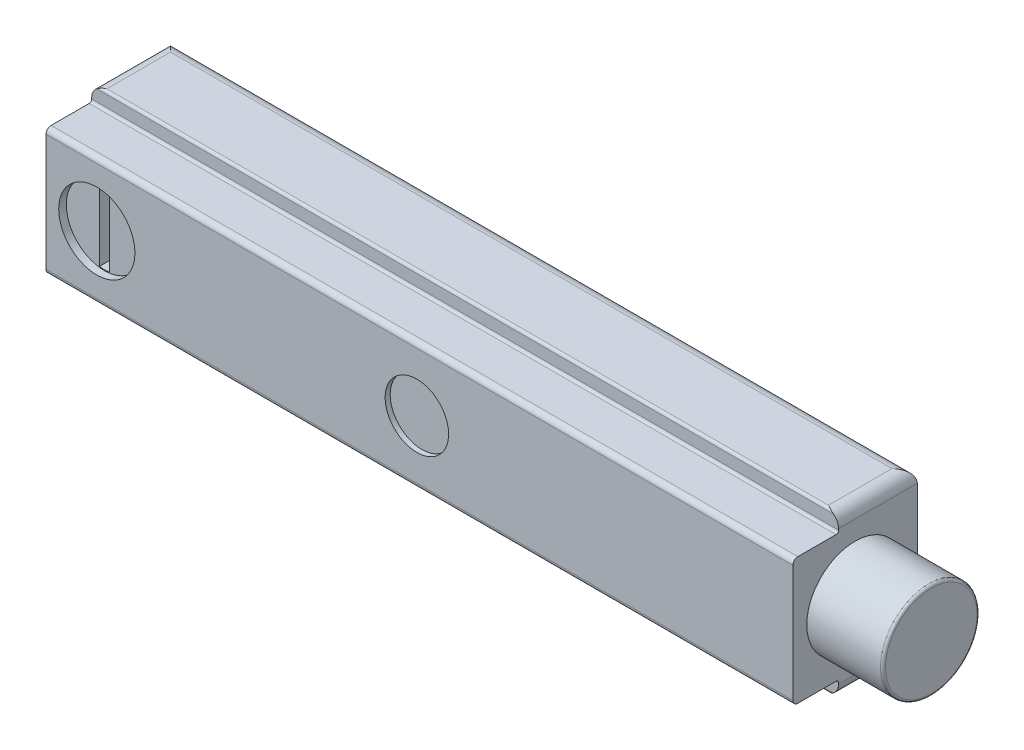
ISO-10303-21;
HEADER;
FILE_DESCRIPTION(('STEP AP214'),'2;1');
FILE_NAME('part.step','',(''),(''),'','','');
FILE_SCHEMA(('AUTOMOTIVE_DESIGN { 1 0 10303 214 1 1 1 1 }'));
ENDSEC;
DATA;
#1=APPLICATION_CONTEXT('core data for automotive mechanical design processes');
#2=APPLICATION_PROTOCOL_DEFINITION('international standard','automotive_design',2000,#1);
#3=PRODUCT_CONTEXT('',#1,'mechanical');
#4=PRODUCT('Part','Part','',(#3));
#5=PRODUCT_RELATED_PRODUCT_CATEGORY('part','',(#4));
#6=PRODUCT_DEFINITION_FORMATION('','',#4);
#7=PRODUCT_DEFINITION_CONTEXT('part definition',#1,'design');
#8=PRODUCT_DEFINITION('design','',#6,#7);
#9=PRODUCT_DEFINITION_SHAPE('','',#8);
#10=(LENGTH_UNIT() NAMED_UNIT(*) SI_UNIT(.MILLI.,.METRE.));
#11=(NAMED_UNIT(*) PLANE_ANGLE_UNIT() SI_UNIT($,.RADIAN.));
#12=(NAMED_UNIT(*) SI_UNIT($,.STERADIAN.) SOLID_ANGLE_UNIT());
#13=UNCERTAINTY_MEASURE_WITH_UNIT(LENGTH_MEASURE(1.E-05),#10,'distance_accuracy_value','');
#14=(GEOMETRIC_REPRESENTATION_CONTEXT(3) GLOBAL_UNCERTAINTY_ASSIGNED_CONTEXT((#13)) GLOBAL_UNIT_ASSIGNED_CONTEXT((#10,
#11,#12)) REPRESENTATION_CONTEXT('',''));
#15=CARTESIAN_POINT('',(0.,0.,0.));
#16=DIRECTION('',(0.,0.,1.));
#17=DIRECTION('',(1.,0.,0.));
#18=AXIS2_PLACEMENT_3D('',#15,#16,#17);
#19=CARTESIAN_POINT('',(2.00000000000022,-1.11022302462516E-13,4.09999999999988));
#20=DIRECTION('',(0.,0.,0.999999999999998));
#21=DIRECTION('',(1.00000000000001,0.,0.));
#22=AXIS2_PLACEMENT_3D('',#19,#20,#21);
#23=PLANE('',#22);
#24=DIRECTION('',(0.,1.00000000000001,0.));
#25=VECTOR('',#24,1.);
#26=CARTESIAN_POINT('',(1.8000000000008,1.45633100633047,4.09999999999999));
#27=LINE('',#26,#25);
#28=CARTESIAN_POINT('',(1.8000000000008,1.45633100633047,4.09999999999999));
#29=VERTEX_POINT('',#28);
#30=CARTESIAN_POINT('',(1.79999999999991,-1.45633100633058,4.09999999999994));
#31=VERTEX_POINT('',#30);
#32=EDGE_CURVE('E921',#29,#31,#27,.F.);
#33=ORIENTED_EDGE('',*,*,#32,.T.);
#34=CARTESIAN_POINT('',(1.80000000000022,-1.45633100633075,4.09999999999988));
#35=CARTESIAN_POINT('',(2.0000000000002,-1.48363927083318,4.09999999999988));
#36=CARTESIAN_POINT('',(2.20000000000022,-1.45633100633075,4.09999999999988));
#37=B_SPLINE_CURVE_WITH_KNOTS('',2,(#34,#35,#36),.UNSPECIFIED.,.F.,.F.,(3,3),(0.,1.),.UNSPECIFIED.);
#38=CARTESIAN_POINT('',(2.20000000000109,-1.45633100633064,4.09999999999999));
#39=VERTEX_POINT('',#38);
#40=EDGE_CURVE('E931',#31,#39,#37,.T.);
#41=ORIENTED_EDGE('',*,*,#40,.T.);
#42=DIRECTION('',(0.,1.00000000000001,0.));
#43=VECTOR('',#42,1.);
#44=CARTESIAN_POINT('',(2.20000000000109,-1.45633100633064,4.09999999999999));
#45=LINE('',#44,#43);
#46=CARTESIAN_POINT('',(2.19999999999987,1.45633100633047,4.09999999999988));
#47=VERTEX_POINT('',#46);
#48=EDGE_CURVE('E974',#39,#47,#45,.T.);
#49=ORIENTED_EDGE('',*,*,#48,.T.);
#50=CARTESIAN_POINT('',(2.20000000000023,1.45633100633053,4.09999999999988));
#51=CARTESIAN_POINT('',(2.00000000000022,1.48363927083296,4.09999999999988));
#52=CARTESIAN_POINT('',(1.80000000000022,1.45633100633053,4.09999999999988));
#53=B_SPLINE_CURVE_WITH_KNOTS('',2,(#50,#51,#52),.UNSPECIFIED.,.F.,.F.,(3,3),(0.,1.),.UNSPECIFIED.);
#54=EDGE_CURVE('E1055',#47,#29,#53,.T.);
#55=ORIENTED_EDGE('',*,*,#54,.T.);
#56=EDGE_LOOP('',(#33,#41,#49,#55));
#57=FACE_BOUND('',#56,.T.);
#58=ADVANCED_FACE('F16',(#57),#23,.T.);
#59=CARTESIAN_POINT('',(2.20000000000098,-1.45633100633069,4.59999999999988));
#60=DIRECTION('',(1.00000000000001,0.,0.));
#61=DIRECTION('',(0.,0.,-0.999999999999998));
#62=AXIS2_PLACEMENT_3D('',#59,#60,#61);
#63=PLANE('',#62);
#64=DIRECTION('',(0.,0.,-0.999999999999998));
#65=VECTOR('',#64,1.);
#66=CARTESIAN_POINT('',(2.20000000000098,-1.45633100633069,4.59999999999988));
#67=LINE('',#66,#65);
#68=CARTESIAN_POINT('',(2.20000000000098,-1.45633100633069,4.59999999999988));
#69=VERTEX_POINT('',#68);
#70=EDGE_CURVE('E967',#39,#69,#67,.F.);
#71=ORIENTED_EDGE('',*,*,#70,.T.);
#72=DIRECTION('',(0.,1.00000000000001,0.));
#73=VECTOR('',#72,1.);
#74=CARTESIAN_POINT('',(2.20000000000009,0.,4.59999999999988));
#75=LINE('',#74,#73);
#76=CARTESIAN_POINT('',(2.19999999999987,1.45633100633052,4.59999999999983));
#77=VERTEX_POINT('',#76);
#78=EDGE_CURVE('E682',#77,#69,#75,.F.);
#79=ORIENTED_EDGE('',*,*,#78,.F.);
#80=DIRECTION('',(0.,0.,-0.999999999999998));
#81=VECTOR('',#80,1.);
#82=CARTESIAN_POINT('',(2.19999999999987,1.45633100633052,4.59999999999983));
#83=LINE('',#82,#81);
#84=EDGE_CURVE('E605',#77,#47,#83,.T.);
#85=ORIENTED_EDGE('',*,*,#84,.T.);
#86=ORIENTED_EDGE('',*,*,#48,.F.);
#87=EDGE_LOOP('',(#71,#79,#85,#86));
#88=FACE_BOUND('',#87,.T.);
#89=ADVANCED_FACE('F957',(#88),#63,.F.);
#90=CARTESIAN_POINT('',(2.00000000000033,-2.22044604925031E-13,4.59999999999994));
#91=DIRECTION('',(0.,0.,-0.999999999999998));
#92=DIRECTION('',(-1.00000000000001,0.,0.));
#93=AXIS2_PLACEMENT_3D('',#90,#91,#92);
#94=CYLINDRICAL_SURFACE('',#93,1.47);
#95=DIRECTION('',(0.,0.,0.999999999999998));
#96=VECTOR('',#95,1.);
#97=CARTESIAN_POINT('',(1.80000000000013,-1.45633100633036,4.59999999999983));
#98=LINE('',#97,#96);
#99=CARTESIAN_POINT('',(1.80000000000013,-1.45633100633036,4.59999999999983));
#100=VERTEX_POINT('',#99);
#101=EDGE_CURVE('E924',#31,#100,#98,.T.);
#102=ORIENTED_EDGE('',*,*,#101,.T.);
#103=CARTESIAN_POINT('',(2.20000000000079,-1.45633100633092,4.59999999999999));
#104=CARTESIAN_POINT('',(2.00000000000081,-1.48363927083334,4.59999999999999));
#105=CARTESIAN_POINT('',(1.80000000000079,-1.45633100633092,4.59999999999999));
#106=B_SPLINE_CURVE_WITH_KNOTS('',2,(#103,#104,#105),.UNSPECIFIED.,.F.,.F.,(3,3),(0.,1.),.UNSPECIFIED.);
#107=EDGE_CURVE('E629',#69,#100,#106,.T.);
#108=ORIENTED_EDGE('',*,*,#107,.F.);
#109=ORIENTED_EDGE('',*,*,#70,.F.);
#110=ORIENTED_EDGE('',*,*,#40,.F.);
#111=EDGE_LOOP('',(#102,#108,#109,#110));
#112=FACE_BOUND('',#111,.T.);
#113=ADVANCED_FACE('F946',(#112),#94,.F.);
#114=CARTESIAN_POINT('',(1.8000000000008,1.45633100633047,4.59999999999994));
#115=DIRECTION('',(-1.00000000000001,0.,0.));
#116=DIRECTION('',(0.,0.,0.999999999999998));
#117=AXIS2_PLACEMENT_3D('',#114,#115,#116);
#118=PLANE('',#117);
#119=DIRECTION('',(0.,0.,-0.999999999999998));
#120=VECTOR('',#119,1.);
#121=CARTESIAN_POINT('',(1.8000000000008,1.45633100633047,4.59999999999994));
#122=LINE('',#121,#120);
#123=CARTESIAN_POINT('',(1.8000000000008,1.45633100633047,4.59999999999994));
#124=VERTEX_POINT('',#123);
#125=EDGE_CURVE('E923',#29,#124,#122,.F.);
#126=ORIENTED_EDGE('',*,*,#125,.T.);
#127=DIRECTION('',(0.,1.00000000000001,0.));
#128=VECTOR('',#127,1.);
#129=CARTESIAN_POINT('',(1.79999999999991,0.,4.59999999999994));
#130=LINE('',#129,#128);
#131=EDGE_CURVE('E675',#100,#124,#130,.T.);
#132=ORIENTED_EDGE('',*,*,#131,.F.);
#133=ORIENTED_EDGE('',*,*,#101,.F.);
#134=ORIENTED_EDGE('',*,*,#32,.F.);
#135=EDGE_LOOP('',(#126,#132,#133,#134));
#136=FACE_BOUND('',#135,.T.);
#137=ADVANCED_FACE('F956',(#136),#118,.F.);
#138=CARTESIAN_POINT('',(2.00000000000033,-2.22044604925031E-13,4.59999999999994));
#139=DIRECTION('',(0.,0.,-0.999999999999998));
#140=DIRECTION('',(-1.00000000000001,0.,0.));
#141=AXIS2_PLACEMENT_3D('',#138,#139,#140);
#142=CYLINDRICAL_SURFACE('',#141,1.47);
#143=ORIENTED_EDGE('',*,*,#84,.F.);
#144=CARTESIAN_POINT('',(1.80000000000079,1.45633100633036,4.59999999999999));
#145=CARTESIAN_POINT('',(2.0000000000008,1.48363927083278,4.59999999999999));
#146=CARTESIAN_POINT('',(2.20000000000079,1.45633100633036,4.59999999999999));
#147=B_SPLINE_CURVE_WITH_KNOTS('',2,(#144,#145,#146),.UNSPECIFIED.,.F.,.F.,(3,3),(0.,1.),.UNSPECIFIED.);
#148=EDGE_CURVE('E467',#124,#77,#147,.T.);
#149=ORIENTED_EDGE('',*,*,#148,.F.);
#150=ORIENTED_EDGE('',*,*,#125,.F.);
#151=ORIENTED_EDGE('',*,*,#54,.F.);
#152=EDGE_LOOP('',(#143,#149,#150,#151));
#153=FACE_BOUND('',#152,.T.);
#154=ADVANCED_FACE('F1062',(#153),#142,.F.);
#155=CARTESIAN_POINT('',(1.11022302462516E-12,-2.60000000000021,3.19999999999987));
#156=DIRECTION('',(1.00000000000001,0.,0.));
#157=DIRECTION('',(0.,0.,-0.999999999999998));
#158=AXIS2_PLACEMENT_3D('',#155,#156,#157);
#159=CYLINDRICAL_SURFACE('',#158,0.100000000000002);
#160=CARTESIAN_POINT('',(1.11022302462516E-12,-2.60000000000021,3.19999999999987));
#161=DIRECTION('',(-1.00000000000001,0.,0.));
#162=DIRECTION('',(0.,1.,0.));
#163=AXIS2_PLACEMENT_3D('',#160,#161,#162);
#164=CIRCLE('',#163,0.100000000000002);
#165=CARTESIAN_POINT('',(6.66133814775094E-13,-2.50000000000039,3.20000000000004));
#166=VERTEX_POINT('',#165);
#167=CARTESIAN_POINT('',(1.11022302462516E-12,-2.60000000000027,3.09999999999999));
#168=VERTEX_POINT('',#167);
#169=EDGE_CURVE('E353',#166,#168,#164,.T.);
#170=ORIENTED_EDGE('',*,*,#169,.T.);
#171=DIRECTION('',(1.00000000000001,0.,0.));
#172=VECTOR('',#171,1.);
#173=CARTESIAN_POINT('',(1.11022302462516E-12,-2.60000000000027,3.09999999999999));
#174=LINE('',#173,#172);
#175=CARTESIAN_POINT('',(29.4,-2.59999999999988,3.09999999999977));
#176=VERTEX_POINT('',#175);
#177=EDGE_CURVE('E606',#176,#168,#174,.F.);
#178=ORIENTED_EDGE('',*,*,#177,.F.);
#179=CARTESIAN_POINT('',(29.4000000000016,-2.60000000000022,3.19999999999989));
#180=DIRECTION('',(1.00000000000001,0.,0.));
#181=DIRECTION('',(-2.98372437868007E-12,0.,-1.));
#182=AXIS2_PLACEMENT_3D('',#179,#180,#181);
#183=CIRCLE('',#182,0.100000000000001);
#184=CARTESIAN_POINT('',(29.4000000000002,-2.50000000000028,3.19999999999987));
#185=VERTEX_POINT('',#184);
#186=EDGE_CURVE('E366',#176,#185,#183,.T.);
#187=ORIENTED_EDGE('',*,*,#186,.T.);
#188=DIRECTION('',(1.00000000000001,0.,0.));
#189=VECTOR('',#188,1.);
#190=CARTESIAN_POINT('',(6.66133814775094E-13,-2.50000000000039,3.20000000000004));
#191=LINE('',#190,#189);
#192=EDGE_CURVE('E369',#166,#185,#191,.T.);
#193=ORIENTED_EDGE('',*,*,#192,.F.);
#194=EDGE_LOOP('',(#170,#178,#187,#193));
#195=FACE_BOUND('',#194,.T.);
#196=ADVANCED_FACE('F370',(#195),#159,.F.);
#197=CARTESIAN_POINT('',(2.22044604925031E-13,2.60000000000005,3.19999999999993));
#198=DIRECTION('',(1.00000000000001,0.,0.));
#199=DIRECTION('',(0.,0.,-0.999999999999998));
#200=AXIS2_PLACEMENT_3D('',#197,#198,#199);
#201=CYLINDRICAL_SURFACE('',#200,0.1);
#202=CARTESIAN_POINT('',(2.21928031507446E-13,2.60000000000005,3.19999999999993));
#203=DIRECTION('',(-1.00000000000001,0.,0.));
#204=DIRECTION('',(0.,0.,-1.));
#205=AXIS2_PLACEMENT_3D('',#202,#203,#204);
#206=CIRCLE('',#205,0.1);
#207=CARTESIAN_POINT('',(0.,2.59999999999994,3.09999999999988));
#208=VERTEX_POINT('',#207);
#209=CARTESIAN_POINT('',(7.7715611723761E-13,2.49999999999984,3.19999999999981));
#210=VERTEX_POINT('',#209);
#211=EDGE_CURVE('E304',#208,#210,#206,.T.);
#212=ORIENTED_EDGE('',*,*,#211,.T.);
#213=DIRECTION('',(1.00000000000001,0.,0.));
#214=VECTOR('',#213,1.);
#215=CARTESIAN_POINT('',(7.7715611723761E-13,2.49999999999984,3.19999999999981));
#216=LINE('',#215,#214);
#217=CARTESIAN_POINT('',(29.4,2.49999999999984,3.20000000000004));
#218=VERTEX_POINT('',#217);
#219=EDGE_CURVE('E460',#218,#210,#216,.F.);
#220=ORIENTED_EDGE('',*,*,#219,.F.);
#221=CARTESIAN_POINT('',(29.4000000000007,2.60000000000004,3.19999999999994));
#222=DIRECTION('',(1.00000000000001,0.,0.));
#223=DIRECTION('',(-2.9837243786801E-12,-1.,0.));
#224=AXIS2_PLACEMENT_3D('',#221,#222,#223);
#225=CIRCLE('',#224,0.1);
#226=CARTESIAN_POINT('',(29.4000000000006,2.59999999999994,3.09999999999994));
#227=VERTEX_POINT('',#226);
#228=EDGE_CURVE('E365',#218,#227,#225,.T.);
#229=ORIENTED_EDGE('',*,*,#228,.T.);
#230=DIRECTION('',(1.00000000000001,0.,0.));
#231=VECTOR('',#230,1.);
#232=CARTESIAN_POINT('',(0.,2.59999999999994,3.09999999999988));
#233=LINE('',#232,#231);
#234=EDGE_CURVE('E741',#208,#227,#233,.T.);
#235=ORIENTED_EDGE('',*,*,#234,.F.);
#236=EDGE_LOOP('',(#212,#220,#229,#235));
#237=FACE_BOUND('',#236,.T.);
#238=ADVANCED_FACE('F1018',(#237),#201,.F.);
#239=CARTESIAN_POINT('',(32.4000000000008,0.899999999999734,2.4499999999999));
#240=DIRECTION('',(1.00000000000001,0.,0.));
#241=DIRECTION('',(0.,0.,-0.999999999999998));
#242=AXIS2_PLACEMENT_3D('',#239,#240,#241);
#243=PLANE('',#242);
#244=CARTESIAN_POINT('',(32.4000000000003,-1.11050058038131E-13,2.45000000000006));
#245=DIRECTION('',(-1.00000000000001,0.,0.));
#246=DIRECTION('',(0.,1.,-1.23599047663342E-13));
#247=AXIS2_PLACEMENT_3D('',#244,#245,#246);
#248=CIRCLE('',#247,1.80000000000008);
#249=CARTESIAN_POINT('',(32.4000000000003,1.79999999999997,2.44999999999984));
#250=VERTEX_POINT('',#249);
#251=EDGE_CURVE('E526',#250,#250,#248,.T.);
#252=ORIENTED_EDGE('',*,*,#251,.F.);
#253=EDGE_LOOP('',(#252));
#254=FACE_BOUND('',#253,.T.);
#255=ADVANCED_FACE('F1001',(#254),#243,.T.);
#256=CARTESIAN_POINT('',(0.,-3.04999999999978,3.09999999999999));
#257=DIRECTION('',(0.,0.,0.999999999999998));
#258=DIRECTION('',(1.00000000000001,0.,0.));
#259=AXIS2_PLACEMENT_3D('',#256,#257,#258);
#260=PLANE('',#259);
#261=CARTESIAN_POINT('',(0.,-2.64999999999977,3.09999999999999));
#262=CARTESIAN_POINT('',(0.000300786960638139,-2.76792550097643,3.09999999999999));
#263=CARTESIAN_POINT('',(0.0527864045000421,-2.87360679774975,3.09999999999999));
#264=CARTESIAN_POINT('',(0.104706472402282,-2.97814934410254,3.09999999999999));
#265=CARTESIAN_POINT('',(0.200000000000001,-3.04999999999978,3.09999999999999));
#266=B_SPLINE_CURVE_WITH_KNOTS('',2,(#261,#262,#263,#264,#265),.UNSPECIFIED.,.F.,.F.,(3,2,3),
(0.,0.5,1.),.UNSPECIFIED.);
#267=CARTESIAN_POINT('',(5.55111512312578E-13,-2.65000000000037,3.09999999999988));
#268=VERTEX_POINT('',#267);
#269=CARTESIAN_POINT('',(0.200000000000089,-3.05000000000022,3.10000000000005));
#270=VERTEX_POINT('',#269);
#271=EDGE_CURVE('E688',#268,#270,#266,.T.);
#272=ORIENTED_EDGE('',*,*,#271,.T.);
#273=DIRECTION('',(1.00000000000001,0.,0.));
#274=VECTOR('',#273,1.);
#275=CARTESIAN_POINT('',(0.,-3.04999999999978,3.09999999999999));
#276=LINE('',#275,#274);
#277=CARTESIAN_POINT('',(29.2000000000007,-3.05000000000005,3.09999999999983));
#278=VERTEX_POINT('',#277);
#279=EDGE_CURVE('E521',#278,#270,#276,.F.);
#280=ORIENTED_EDGE('',*,*,#279,.F.);
#281=CARTESIAN_POINT('',(29.2000000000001,-3.04999999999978,3.10000000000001));
#282=CARTESIAN_POINT('',(29.2941599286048,-2.97900406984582,3.10000000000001));
#283=CARTESIAN_POINT('',(29.3472135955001,-2.87360679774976,3.10000000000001));
#284=CARTESIAN_POINT('',(29.3996955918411,-2.76934521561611,3.10000000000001));
#285=CARTESIAN_POINT('',(29.4000000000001,-2.64999999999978,3.10000000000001));
#286=B_SPLINE_CURVE_WITH_KNOTS('',2,(#281,#282,#283,#284,#285),.UNSPECIFIED.,.F.,.F.,(3,2,3),
(0.,0.5,1.),.UNSPECIFIED.);
#287=CARTESIAN_POINT('',(29.4000000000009,-2.65000000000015,3.09999999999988));
#288=VERTEX_POINT('',#287);
#289=EDGE_CURVE('E612',#278,#288,#286,.T.);
#290=ORIENTED_EDGE('',*,*,#289,.T.);
#291=DIRECTION('',(0.,1.00000000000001,0.));
#292=VECTOR('',#291,1.);
#293=CARTESIAN_POINT('',(29.4000000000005,-3.05000000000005,3.09999999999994));
#294=LINE('',#293,#292);
#295=EDGE_CURVE('E602',#288,#176,#294,.T.);
#296=ORIENTED_EDGE('',*,*,#295,.T.);
#297=ORIENTED_EDGE('',*,*,#177,.T.);
#298=DIRECTION('',(0.,1.00000000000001,0.));
#299=VECTOR('',#298,1.);
#300=CARTESIAN_POINT('',(0.,-3.04999999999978,3.09999999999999));
#301=LINE('',#300,#299);
#302=EDGE_CURVE('E359',#168,#268,#301,.F.);
#303=ORIENTED_EDGE('',*,*,#302,.T.);
#304=EDGE_LOOP('',(#272,#280,#290,#296,#297,#303));
#305=FACE_BOUND('',#304,.T.);
#306=ADVANCED_FACE('F611',(#305),#260,.T.);
#307=CARTESIAN_POINT('',(7.7715611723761E-13,-2.77555756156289E-13,4.59999999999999));
#308=DIRECTION('',(0.,0.,0.999999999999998));
#309=DIRECTION('',(1.00000000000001,0.,0.));
#310=AXIS2_PLACEMENT_3D('',#307,#308,#309);
#311=PLANE('',#310);
#312=CARTESIAN_POINT('',(3.50000000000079,-2.78527201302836E-13,4.59999999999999));
#313=CARTESIAN_POINT('',(3.49989883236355,0.28610338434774,4.59999999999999));
#314=CARTESIAN_POINT('',(3.39468245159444,0.552142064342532,4.59999999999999));
#315=CARTESIAN_POINT('',(3.28062366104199,0.840538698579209,4.59999999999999));
#316=CARTESIAN_POINT('',(3.06066017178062,1.06066017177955,4.59999999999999));
#317=CARTESIAN_POINT('',(2.84144160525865,1.28003618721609,4.59999999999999));
#318=CARTESIAN_POINT('',(2.5521420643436,1.39468245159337,4.59999999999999));
#319=CARTESIAN_POINT('',(2.2866384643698,1.49989864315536,4.59999999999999));
#320=CARTESIAN_POINT('',(2.00000000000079,1.49999999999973,4.59999999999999));
#321=CARTESIAN_POINT('',(1.71440776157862,1.50010098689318,4.59999999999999));
#322=CARTESIAN_POINT('',(1.44785793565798,1.39468245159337,4.59999999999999));
#323=CARTESIAN_POINT('',(1.15946130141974,1.28062366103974,4.59999999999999));
#324=CARTESIAN_POINT('',(0.939339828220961,1.06066017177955,4.59999999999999));
#325=CARTESIAN_POINT('',(0.719963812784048,0.841441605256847,4.59999999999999));
#326=CARTESIAN_POINT('',(0.605317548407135,0.552142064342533,4.59999999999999));
#327=CARTESIAN_POINT('',(0.500101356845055,0.28663846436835,4.59999999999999));
#328=CARTESIAN_POINT('',(0.50000000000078,-2.77878224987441E-13,4.59999999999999));
#329=B_SPLINE_CURVE_WITH_KNOTS('',2,(#312,#313,#314,#315,#316,#317,#318,#319,#320,#321,#322,
#323,#324,#325,#326,#327,#328),.UNSPECIFIED.,.F.,.F.,(3,2,2,2,2,2,2,2,3),(0.,0.125,0.25,0.375,
0.5,0.625,0.75,0.875,1.),.UNSPECIFIED.);
#330=CARTESIAN_POINT('',(3.50000000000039,-1.11022302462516E-13,4.59999999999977));
#331=VERTEX_POINT('',#330);
#332=CARTESIAN_POINT('',(0.500000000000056,-2.77555756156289E-13,4.59999999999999));
#333=VERTEX_POINT('',#332);
#334=EDGE_CURVE('E512',#331,#333,#329,.T.);
#335=ORIENTED_EDGE('',*,*,#334,.T.);
#336=CARTESIAN_POINT('',(0.50000000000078,-2.77878224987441E-13,4.59999999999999));
#337=CARTESIAN_POINT('',(0.500101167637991,-0.286103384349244,4.59999999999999));
#338=CARTESIAN_POINT('',(0.605317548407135,-0.552142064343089,4.59999999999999));
#339=CARTESIAN_POINT('',(0.719376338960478,-0.840538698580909,4.59999999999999));
#340=CARTESIAN_POINT('',(0.93933982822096,-1.0606601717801,4.59999999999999));
#341=CARTESIAN_POINT('',(1.15855839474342,-1.2800361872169,4.59999999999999));
#342=CARTESIAN_POINT('',(1.44785793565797,-1.39468245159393,4.59999999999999));
#343=CARTESIAN_POINT('',(1.71336153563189,-1.49989864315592,4.59999999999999));
#344=CARTESIAN_POINT('',(2.00000000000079,-1.50000000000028,4.59999999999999));
#345=CARTESIAN_POINT('',(2.28559223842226,-1.50010098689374,4.59999999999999));
#346=CARTESIAN_POINT('',(2.5521420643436,-1.39468245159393,4.59999999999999));
#347=CARTESIAN_POINT('',(2.84053869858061,-1.28062366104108,4.59999999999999));
#348=CARTESIAN_POINT('',(3.06066017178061,-1.0606601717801,4.59999999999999));
#349=CARTESIAN_POINT('',(3.28003618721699,-0.841441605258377,4.59999999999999));
#350=CARTESIAN_POINT('',(3.39468245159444,-0.55214206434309,4.59999999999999));
#351=CARTESIAN_POINT('',(3.49989864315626,-0.286638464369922,4.59999999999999));
#352=CARTESIAN_POINT('',(3.50000000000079,-2.78527201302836E-13,4.59999999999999));
#353=B_SPLINE_CURVE_WITH_KNOTS('',2,(#336,#337,#338,#339,#340,#341,#342,#343,#344,#345,#346,
#347,#348,#349,#350,#351,#352),.UNSPECIFIED.,.F.,.F.,(3,2,2,2,2,2,2,2,3),(0.,0.125,0.25,0.375,
0.5,0.625,0.75,0.875,1.),.UNSPECIFIED.);
#354=EDGE_CURVE('E514',#333,#331,#353,.T.);
#355=ORIENTED_EDGE('',*,*,#354,.T.);
#356=EDGE_LOOP('',(#335,#355));
#357=FACE_BOUND('',#356,.T.);
#358=ORIENTED_EDGE('',*,*,#131,.T.);
#359=ORIENTED_EDGE('',*,*,#148,.T.);
#360=ORIENTED_EDGE('',*,*,#78,.T.);
#361=ORIENTED_EDGE('',*,*,#107,.T.);
#362=EDGE_LOOP('',(#358,#359,#360,#361));
#363=FACE_BOUND('',#362,.T.);
#364=ADVANCED_FACE('F636',(#357,#363),#311,.T.);
#365=CARTESIAN_POINT('',(7.7715611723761E-13,-3.33066907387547E-13,4.69999999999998));
#366=DIRECTION('',(0.,0.,0.999999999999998));
#367=DIRECTION('',(1.00000000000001,0.,0.));
#368=AXIS2_PLACEMENT_3D('',#365,#366,#367);
#369=PLANE('',#368);
#370=CARTESIAN_POINT('',(15.8500000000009,-3.37466166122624E-13,4.69999999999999));
#371=CARTESIAN_POINT('',(15.8498988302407,0.23841750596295,4.69999999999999));
#372=CARTESIAN_POINT('',(15.7622353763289,0.460118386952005,4.69999999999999));
#373=CARTESIAN_POINT('',(15.6672352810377,0.700373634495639,4.69999999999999));
#374=CARTESIAN_POINT('',(15.483883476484,0.883883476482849,4.69999999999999));
#375=CARTESIAN_POINT('',(15.3012765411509,1.06664780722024,4.69999999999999));
#376=CARTESIAN_POINT('',(15.0601183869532,1.1622353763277,4.69999999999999));
#377=CARTESIAN_POINT('',(14.8389525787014,1.24989860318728,4.69999999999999));
#378=CARTESIAN_POINT('',(14.6000000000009,1.24999999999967,4.69999999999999));
#379=CARTESIAN_POINT('',(14.3620936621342,1.25010095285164,4.69999999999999));
#380=CARTESIAN_POINT('',(14.1398816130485,1.1622353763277,4.69999999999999));
#381=CARTESIAN_POINT('',(13.8996263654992,1.06723528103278,4.69999999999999));
#382=CARTESIAN_POINT('',(13.7161165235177,0.88388347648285,4.69999999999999));
#383=CARTESIAN_POINT('',(13.5333521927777,0.701276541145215,4.69999999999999));
#384=CARTESIAN_POINT('',(13.4377646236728,0.460118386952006,4.69999999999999));
#385=CARTESIAN_POINT('',(13.3501013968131,0.23895257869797,4.69999999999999));
#386=CARTESIAN_POINT('',(13.3500000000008,-3.36925352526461E-13,4.69999999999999));
#387=B_SPLINE_CURVE_WITH_KNOTS('',2,(#370,#371,#372,#373,#374,#375,#376,#377,#378,#379,#380,
#381,#382,#383,#384,#385,#386),.UNSPECIFIED.,.F.,.F.,(3,2,2,2,2,2,2,2,3),(0.,0.125,0.25,0.375,
0.5,0.625,0.75,0.875,1.),.UNSPECIFIED.);
#388=CARTESIAN_POINT('',(15.85,-1.11022302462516E-13,4.70000000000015));
#389=VERTEX_POINT('',#388);
#390=CARTESIAN_POINT('',(13.3500000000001,-1.66533453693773E-13,4.69999999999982));
#391=VERTEX_POINT('',#390);
#392=EDGE_CURVE('E519',#389,#391,#387,.T.);
#393=ORIENTED_EDGE('',*,*,#392,.T.);
#394=CARTESIAN_POINT('',(13.3500000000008,-3.36925352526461E-13,4.69999999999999));
#395=CARTESIAN_POINT('',(13.3501011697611,-0.238417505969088,4.69999999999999));
#396=CARTESIAN_POINT('',(13.4377646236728,-0.460118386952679,4.69999999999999));
#397=CARTESIAN_POINT('',(13.5327647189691,-0.700373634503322,4.69999999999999));
#398=CARTESIAN_POINT('',(13.7161165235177,-0.883883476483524,4.69999999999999));
#399=CARTESIAN_POINT('',(13.8987234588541,-1.0666478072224,4.69999999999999));
#400=CARTESIAN_POINT('',(14.1398816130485,-1.16223537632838,4.69999999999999));
#401=CARTESIAN_POINT('',(14.3610474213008,-1.249898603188,4.69999999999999));
#402=CARTESIAN_POINT('',(14.6000000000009,-1.25000000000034,4.69999999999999));
#403=CARTESIAN_POINT('',(14.8379063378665,-1.25010095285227,4.69999999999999));
#404=CARTESIAN_POINT('',(15.0601183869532,-1.16223537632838,4.69999999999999));
#405=CARTESIAN_POINT('',(15.3003736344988,-1.0672352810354,4.69999999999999));
#406=CARTESIAN_POINT('',(15.483883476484,-0.883883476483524,4.69999999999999));
#407=CARTESIAN_POINT('',(15.6666478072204,-0.701276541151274,4.69999999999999));
#408=CARTESIAN_POINT('',(15.7622353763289,-0.46011838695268,4.69999999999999));
#409=CARTESIAN_POINT('',(15.8498986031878,-0.238952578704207,4.69999999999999));
#410=CARTESIAN_POINT('',(15.8500000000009,-3.37466166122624E-13,4.69999999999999));
#411=B_SPLINE_CURVE_WITH_KNOTS('',2,(#394,#395,#396,#397,#398,#399,#400,#401,#402,#403,#404,
#405,#406,#407,#408,#409,#410),.UNSPECIFIED.,.F.,.F.,(3,2,2,2,2,2,2,2,3),(0.,0.125,0.25,0.375,
0.5,0.625,0.75,0.875,1.),.UNSPECIFIED.);
#412=EDGE_CURVE('E451',#391,#389,#411,.T.);
#413=ORIENTED_EDGE('',*,*,#412,.T.);
#414=EDGE_LOOP('',(#393,#413));
#415=FACE_BOUND('',#414,.T.);
#416=ADVANCED_FACE('F646',(#415),#369,.T.);
#417=CARTESIAN_POINT('',(8.88178419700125E-13,2.50000000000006,4.69999999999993));
#418=DIRECTION('',(0.,1.00000000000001,0.));
#419=DIRECTION('',(0.,0.,0.999999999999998));
#420=AXIS2_PLACEMENT_3D('',#417,#418,#419);
#421=PLANE('',#420);
#422=DIRECTION('',(0.,0.,0.999999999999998));
#423=VECTOR('',#422,1.);
#424=CARTESIAN_POINT('',(8.88178419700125E-13,2.50000000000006,4.69999999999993));
#425=LINE('',#424,#423);
#426=CARTESIAN_POINT('',(8.88178419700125E-13,2.50000000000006,4.69999999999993));
#427=VERTEX_POINT('',#426);
#428=EDGE_CURVE('E386',#210,#427,#425,.T.);
#429=ORIENTED_EDGE('',*,*,#428,.T.);
#430=DIRECTION('',(1.00000000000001,0.,0.));
#431=VECTOR('',#430,1.);
#432=CARTESIAN_POINT('',(8.88178419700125E-13,2.50000000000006,4.69999999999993));
#433=LINE('',#432,#431);
#434=CARTESIAN_POINT('',(29.3999999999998,2.50000000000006,4.69999999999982));
#435=VERTEX_POINT('',#434);
#436=EDGE_CURVE('E439',#435,#427,#433,.F.);
#437=ORIENTED_EDGE('',*,*,#436,.F.);
#438=DIRECTION('',(0.,0.,0.999999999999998));
#439=VECTOR('',#438,1.);
#440=CARTESIAN_POINT('',(29.3999999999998,2.50000000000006,4.69999999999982));
#441=LINE('',#440,#439);
#442=EDGE_CURVE('E463',#435,#218,#441,.F.);
#443=ORIENTED_EDGE('',*,*,#442,.T.);
#444=ORIENTED_EDGE('',*,*,#219,.T.);
#445=EDGE_LOOP('',(#429,#437,#443,#444));
#446=FACE_BOUND('',#445,.T.);
#447=ADVANCED_FACE('F1171',(#446),#421,.T.);
#448=CARTESIAN_POINT('',(6.66133814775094E-13,-2.50000000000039,3.20000000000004));
#449=DIRECTION('',(0.,-1.00000000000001,0.));
#450=DIRECTION('',(0.,0.,-0.999999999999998));
#451=AXIS2_PLACEMENT_3D('',#448,#449,#450);
#452=PLANE('',#451);
#453=DIRECTION('',(0.,0.,-0.999999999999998));
#454=VECTOR('',#453,1.);
#455=CARTESIAN_POINT('',(6.66133814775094E-13,-2.50000000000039,3.20000000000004));
#456=LINE('',#455,#454);
#457=CARTESIAN_POINT('',(6.66133814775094E-13,-2.50000000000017,4.69999999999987));
#458=VERTEX_POINT('',#457);
#459=EDGE_CURVE('E356',#458,#166,#456,.T.);
#460=ORIENTED_EDGE('',*,*,#459,.T.);
#461=ORIENTED_EDGE('',*,*,#192,.T.);
#462=DIRECTION('',(0.,0.,-0.999999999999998));
#463=VECTOR('',#462,1.);
#464=CARTESIAN_POINT('',(29.4000000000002,-2.50000000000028,3.19999999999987));
#465=LINE('',#464,#463);
#466=CARTESIAN_POINT('',(29.3999999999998,-2.50000000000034,4.69999999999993));
#467=VERTEX_POINT('',#466);
#468=EDGE_CURVE('E381',#185,#467,#465,.F.);
#469=ORIENTED_EDGE('',*,*,#468,.T.);
#470=DIRECTION('',(1.00000000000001,0.,0.));
#471=VECTOR('',#470,1.);
#472=CARTESIAN_POINT('',(6.66133814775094E-13,-2.50000000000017,4.69999999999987));
#473=LINE('',#472,#471);
#474=EDGE_CURVE('E379',#458,#467,#473,.T.);
#475=ORIENTED_EDGE('',*,*,#474,.F.);
#476=EDGE_LOOP('',(#460,#461,#469,#475));
#477=FACE_BOUND('',#476,.T.);
#478=ADVANCED_FACE('F377',(#477),#452,.T.);
#479=CARTESIAN_POINT('',(0.,2.59999999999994,3.09999999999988));
#480=DIRECTION('',(0.,0.,0.999999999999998));
#481=DIRECTION('',(1.00000000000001,0.,0.));
#482=AXIS2_PLACEMENT_3D('',#479,#480,#481);
#483=PLANE('',#482);
#484=ORIENTED_EDGE('',*,*,#234,.T.);
#485=DIRECTION('',(0.,1.00000000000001,0.));
#486=VECTOR('',#485,1.);
#487=CARTESIAN_POINT('',(29.4000000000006,2.59999999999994,3.09999999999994));
#488=LINE('',#487,#486);
#489=CARTESIAN_POINT('',(29.4000000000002,2.64999999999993,3.09999999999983));
#490=VERTEX_POINT('',#489);
#491=EDGE_CURVE('E533',#227,#490,#488,.T.);
#492=ORIENTED_EDGE('',*,*,#491,.T.);
#493=CARTESIAN_POINT('',(29.4000000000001,2.64999999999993,3.0999999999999));
#494=CARTESIAN_POINT('',(29.3996992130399,2.76792550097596,3.0999999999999));
#495=CARTESIAN_POINT('',(29.3472135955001,2.87360679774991,3.0999999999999));
#496=CARTESIAN_POINT('',(29.2952935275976,2.978149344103,3.0999999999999));
#497=CARTESIAN_POINT('',(29.2000000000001,3.04999999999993,3.0999999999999));
#498=B_SPLINE_CURVE_WITH_KNOTS('',2,(#493,#494,#495,#496,#497),.UNSPECIFIED.,.F.,.F.,(3,2,3),
(0.,0.5,1.),.UNSPECIFIED.);
#499=CARTESIAN_POINT('',(29.1999999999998,3.05,3.10000000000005));
#500=VERTEX_POINT('',#499);
#501=EDGE_CURVE('E375',#490,#500,#498,.T.);
#502=ORIENTED_EDGE('',*,*,#501,.T.);
#503=DIRECTION('',(1.00000000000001,0.,0.));
#504=VECTOR('',#503,1.);
#505=CARTESIAN_POINT('',(-1.11022302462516E-13,3.05,3.09999999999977));
#506=LINE('',#505,#504);
#507=CARTESIAN_POINT('',(0.200000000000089,3.04999999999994,3.09999999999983));
#508=VERTEX_POINT('',#507);
#509=EDGE_CURVE('E428',#508,#500,#506,.T.);
#510=ORIENTED_EDGE('',*,*,#509,.F.);
#511=CARTESIAN_POINT('',(0.200000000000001,3.04999999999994,3.09999999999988));
#512=CARTESIAN_POINT('',(0.105840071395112,2.97900406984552,3.09999999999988));
#513=CARTESIAN_POINT('',(0.0527864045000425,2.87360679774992,3.09999999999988));
#514=CARTESIAN_POINT('',(0.000304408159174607,2.76934521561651,3.09999999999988));
#515=CARTESIAN_POINT('',(0.,2.64999999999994,3.09999999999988));
#516=B_SPLINE_CURVE_WITH_KNOTS('',2,(#511,#512,#513,#514,#515),.UNSPECIFIED.,.F.,.F.,(3,2,3),
(0.,0.5,1.),.UNSPECIFIED.);
#517=CARTESIAN_POINT('',(7.7715611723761E-13,2.64999999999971,3.09999999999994));
#518=VERTEX_POINT('',#517);
#519=EDGE_CURVE('E185',#508,#518,#516,.T.);
#520=ORIENTED_EDGE('',*,*,#519,.T.);
#521=DIRECTION('',(0.,1.00000000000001,0.));
#522=VECTOR('',#521,1.);
#523=CARTESIAN_POINT('',(0.,2.59999999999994,3.09999999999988));
#524=LINE('',#523,#522);
#525=EDGE_CURVE('E744',#518,#208,#524,.F.);
#526=ORIENTED_EDGE('',*,*,#525,.T.);
#527=EDGE_LOOP('',(#484,#492,#502,#510,#520,#526));
#528=FACE_BOUND('',#527,.T.);
#529=ADVANCED_FACE('F718',(#528),#483,.T.);
#530=CARTESIAN_POINT('',(32.3000000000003,-1.11022302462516E-13,2.45000000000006));
#531=DIRECTION('',(-1.00000000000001,0.,0.));
#532=DIRECTION('',(0.,1.23358113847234E-13,1.));
#533=AXIS2_PLACEMENT_3D('',#530,#531,#532);
#534=TOROIDAL_SURFACE('',#533,1.80000000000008,0.0999999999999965);
#535=ORIENTED_EDGE('',*,*,#251,.T.);
#536=EDGE_LOOP('',(#535));
#537=FACE_BOUND('',#536,.T.);
#538=CARTESIAN_POINT('',(32.3000000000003,-1.11022302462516E-13,2.45000000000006));
#539=DIRECTION('',(-1.00000000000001,0.,0.));
#540=DIRECTION('',(0.,0.,0.999999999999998));
#541=AXIS2_PLACEMENT_3D('',#538,#539,#540);
#542=CIRCLE('',#541,1.9);
#543=CARTESIAN_POINT('',(32.3000000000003,-1.11022302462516E-13,4.35000000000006));
#544=VERTEX_POINT('',#543);
#545=EDGE_CURVE('E431',#544,#544,#542,.T.);
#546=ORIENTED_EDGE('',*,*,#545,.F.);
#547=EDGE_LOOP('',(#546));
#548=FACE_BOUND('',#547,.T.);
#549=ADVANCED_FACE('F728',(#537,#548),#534,.T.);
#550=CARTESIAN_POINT('',(0.,-3.04999999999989,2.99999999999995));
#551=DIRECTION('',(1.00000000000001,0.,0.));
#552=DIRECTION('',(0.,0.,-0.999999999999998));
#553=AXIS2_PLACEMENT_3D('',#550,#551,#552);
#554=CYLINDRICAL_SURFACE('',#553,0.100000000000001);
#555=CARTESIAN_POINT('',(0.200000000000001,-3.04999999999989,3.09999999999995));
#556=CARTESIAN_POINT('',(0.202239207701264,-3.05167923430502,3.09999989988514));
#557=CARTESIAN_POINT('',(0.204493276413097,-3.0533383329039,3.09995770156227));
#558=CARTESIAN_POINT('',(0.20910234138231,-3.05666927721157,3.09979176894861));
#559=CARTESIAN_POINT('',(0.211458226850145,-3.05833976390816,3.09966541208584));
#560=CARTESIAN_POINT('',(0.216270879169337,-3.06168914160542,3.09932917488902));
#561=CARTESIAN_POINT('',(0.218728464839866,-3.06336659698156,3.09911675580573));
#562=CARTESIAN_POINT('',(0.223744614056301,-3.06672538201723,3.09860647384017));
#563=CARTESIAN_POINT('',(0.22630393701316,-3.06840520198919,3.09830615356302));
#564=CARTESIAN_POINT('',(0.231523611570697,-3.07176396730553,3.09761842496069));
#565=CARTESIAN_POINT('',(0.234184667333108,-3.07344133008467,3.09722864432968));
#566=CARTESIAN_POINT('',(0.239607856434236,-3.07679022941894,3.09636059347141));
#567=CARTESIAN_POINT('',(0.242370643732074,-3.07846011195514,3.09588003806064));
#568=CARTESIAN_POINT('',(0.247997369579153,-3.08178892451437,3.09482931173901));
#569=CARTESIAN_POINT('',(0.250861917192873,-3.08344613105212,3.09425694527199));
#570=CARTESIAN_POINT('',(0.256692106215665,-3.08674422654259,3.09302176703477));
#571=CARTESIAN_POINT('',(0.259658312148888,-3.08838332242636,3.09235685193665));
#572=CARTESIAN_POINT('',(0.268832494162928,-3.09333473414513,3.09019660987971));
#573=CARTESIAN_POINT('',(0.2750724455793,-3.09653676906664,3.08858178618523));
#574=CARTESIAN_POINT('',(0.287954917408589,-3.10281586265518,3.0849955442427));
#575=CARTESIAN_POINT('',(0.294601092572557,-3.10587703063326,3.08300965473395));
#576=CARTESIAN_POINT('',(0.308297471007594,-3.11182720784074,3.07868681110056));
#577=CARTESIAN_POINT('',(0.315350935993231,-3.11469937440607,3.07633708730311));
#578=CARTESIAN_POINT('',(0.329860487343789,-3.1202263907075,3.07129443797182));
#579=CARTESIAN_POINT('',(0.337319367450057,-3.12286369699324,3.06859033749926));
#580=CARTESIAN_POINT('',(0.349186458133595,-3.12673338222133,3.06416158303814));
#581=CARTESIAN_POINT('',(0.353575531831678,-3.12809445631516,3.06249639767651));
#582=CARTESIAN_POINT('',(0.36294578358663,-3.13085675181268,3.0588897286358));
#583=CARTESIAN_POINT('',(0.36792934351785,-3.13223995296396,3.05694058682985));
#584=CARTESIAN_POINT('',(0.378487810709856,-3.13499993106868,3.0527448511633));
#585=CARTESIAN_POINT('',(0.384064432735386,-3.13635745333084,3.0504899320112));
#586=CARTESIAN_POINT('',(0.395809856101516,-3.13901002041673,3.04566787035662));
#587=CARTESIAN_POINT('',(0.401980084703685,-3.14028398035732,3.04309260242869));
#588=CARTESIAN_POINT('',(0.414912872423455,-3.14270631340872,3.03762061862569));
#589=CARTESIAN_POINT('',(0.421676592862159,-3.1438316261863,3.03471644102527));
#590=CARTESIAN_POINT('',(0.435796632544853,-3.14588608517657,3.02858648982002));
#591=CARTESIAN_POINT('',(0.44315392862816,-3.14679006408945,3.02535452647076));
#592=CARTESIAN_POINT('',(0.458461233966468,-3.14832477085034,3.01858030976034));
#593=CARTESIAN_POINT('',(0.466412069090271,-3.14892821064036,3.01503374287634));
#594=CARTESIAN_POINT('',(0.482906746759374,-3.14978073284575,3.00765609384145));
#595=CARTESIAN_POINT('',(0.491451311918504,-3.15000057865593,3.00382322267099));
#596=CARTESIAN_POINT('',(0.500000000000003,-3.14999999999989,2.99999999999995));
#597=B_SPLINE_CURVE_WITH_KNOTS('',3,(#555,#556,#557,#558,#559,#560,#561,#562,#563,#564,#565,
#566,#567,#568,#569,#570,#571,#572,#573,#574,#575,#576,#577,#578,#579,#580,#581,#582,#583,#584,
#585,#586,#587,#588,#589,#590,#591,#592,#593,#594,#595,#596),.UNSPECIFIED.,.F.,.F.,(4,2,2,2,2,2,
2,2,2,2,2,2,2,2,2,2,2,2,2,2,4),(0.,0.00839601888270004,0.017066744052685,0.0260144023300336,
0.0352410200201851,0.044748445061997,0.0545383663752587,0.0646123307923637,0.074971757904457,
0.096549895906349,0.119284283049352,0.143182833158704,0.168252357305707,0.182913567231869,
0.199491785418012,0.21798785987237,0.238402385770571,0.260735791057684,0.284988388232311,
0.311160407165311,0.339252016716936),.UNSPECIFIED.);
#598=CARTESIAN_POINT('',(0.499999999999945,-3.15000000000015,3.));
#599=VERTEX_POINT('',#598);
#600=EDGE_CURVE('E269',#270,#599,#597,.T.);
#601=ORIENTED_EDGE('',*,*,#600,.T.);
#602=DIRECTION('',(1.00000000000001,0.,0.));
#603=VECTOR('',#602,1.);
#604=CARTESIAN_POINT('',(-1.11022302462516E-13,-3.1500000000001,2.99999999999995));
#605=LINE('',#604,#603);
#606=CARTESIAN_POINT('',(28.9000000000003,-3.1500000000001,2.99999999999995));
#607=VERTEX_POINT('',#606);
#608=EDGE_CURVE('E192',#607,#599,#605,.F.);
#609=ORIENTED_EDGE('',*,*,#608,.F.);
#610=CARTESIAN_POINT('',(28.9000000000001,-3.1499999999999,2.99999999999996));
#611=CARTESIAN_POINT('',(28.9085467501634,-3.150000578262,3.00382235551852));
#612=CARTESIAN_POINT('',(28.9170893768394,-3.14978083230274,3.0076543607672));
#613=CARTESIAN_POINT('',(28.9335807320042,-3.14892867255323,3.01503055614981));
#614=CARTESIAN_POINT('',(28.9415301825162,-3.14832546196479,3.01857653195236));
#615=CARTESIAN_POINT('',(28.9568352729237,-3.14679127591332,3.02534985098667));
#616=CARTESIAN_POINT('',(28.9641917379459,-3.1458875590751,3.02858150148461));
#617=CARTESIAN_POINT('',(28.978310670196,-3.14383359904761,3.03471109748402));
#618=CARTESIAN_POINT('',(28.9850741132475,-3.1427084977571,3.03761522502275));
#619=CARTESIAN_POINT('',(28.9980069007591,-3.14028648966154,3.04308735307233));
#620=CARTESIAN_POINT('',(29.0041774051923,-3.13901262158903,3.04566280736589));
#621=CARTESIAN_POINT('',(29.0159239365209,-3.13636008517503,3.05048544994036));
#622=CARTESIAN_POINT('',(29.0215013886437,-3.13500248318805,3.05274075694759));
#623=CARTESIAN_POINT('',(29.032062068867,-3.13224214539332,3.05693744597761));
#624=CARTESIAN_POINT('',(29.037047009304,-3.13085864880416,3.05888714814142));
#625=CARTESIAN_POINT('',(29.0464205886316,-3.12809555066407,3.06249506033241));
#626=CARTESIAN_POINT('',(29.0508116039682,-3.1267339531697,3.06416092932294));
#627=CARTESIAN_POINT('',(29.0626799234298,-3.12286403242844,3.06858995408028));
#628=CARTESIAN_POINT('',(29.0701381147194,-3.12022713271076,3.07129368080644));
#629=CARTESIAN_POINT('',(29.0846464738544,-3.11470087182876,3.0763357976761));
#630=CARTESIAN_POINT('',(29.0916994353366,-3.1118290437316,3.07868535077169));
#631=CARTESIAN_POINT('',(29.1053950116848,-3.10587946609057,3.08300800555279));
#632=CARTESIAN_POINT('',(29.1120408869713,-3.10281854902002,3.08499386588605));
#633=CARTESIAN_POINT('',(29.1249229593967,-3.09653983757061,3.08858017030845));
#634=CARTESIAN_POINT('',(29.1311628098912,-3.09333792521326,3.09019507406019));
#635=CARTESIAN_POINT('',(29.1403369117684,-3.08838663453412,3.0923554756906));
#636=CARTESIAN_POINT('',(29.143303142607,-3.0867475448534,3.09302045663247));
#637=CARTESIAN_POINT('',(29.1491334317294,-3.08344942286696,3.09425577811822));
#638=CARTESIAN_POINT('',(29.1519980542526,-3.08179218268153,3.09482822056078));
#639=CARTESIAN_POINT('',(29.1576249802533,-3.07846326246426,3.09587910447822));
#640=CARTESIAN_POINT('',(29.1603878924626,-3.07679330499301,3.09635974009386));
#641=CARTESIAN_POINT('',(29.1658113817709,-3.07344421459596,3.09722795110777));
#642=CARTESIAN_POINT('',(29.168472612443,-3.07176673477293,3.09761781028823));
#643=CARTESIAN_POINT('',(29.1736926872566,-3.06840769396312,3.09830568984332));
#644=CARTESIAN_POINT('',(29.1762522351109,-3.06672771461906,3.09860608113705));
#645=CARTESIAN_POINT('',(29.1812688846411,-3.06336856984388,3.09911649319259));
#646=CARTESIAN_POINT('',(29.1837267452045,-3.06169091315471,3.09932896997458));
#647=CARTESIAN_POINT('',(29.1885399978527,-3.05834109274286,3.09966530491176));
#648=CARTESIAN_POINT('',(29.1908962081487,-3.05667036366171,3.09979170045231));
#649=CARTESIAN_POINT('',(29.1955059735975,-3.05333889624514,3.09995768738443));
#650=CARTESIAN_POINT('',(29.1977604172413,-3.05167951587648,3.09999989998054));
#651=CARTESIAN_POINT('',(29.2000000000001,-3.0499999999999,3.09999999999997));
#652=B_SPLINE_CURVE_WITH_KNOTS('',3,(#610,#611,#612,#613,#614,#615,#616,#617,#618,#619,#620,
#621,#622,#623,#624,#625,#626,#627,#628,#629,#630,#631,#632,#633,#634,#635,#636,#637,#638,#639,
#640,#641,#642,#643,#644,#645,#646,#647,#648,#649,#650,#651),.UNSPECIFIED.,.F.,.F.,(4,2,2,2,2,2,
2,2,2,2,2,2,2,2,2,2,2,2,2,2,4),(0.,0.0280852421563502,0.0542527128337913,0.0785025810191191,
0.100835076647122,0.121250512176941,0.139749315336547,0.156332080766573,0.17099965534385,
0.196066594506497,0.219963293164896,0.242696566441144,0.264274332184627,0.274633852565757,
0.284708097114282,0.294498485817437,0.30400656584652,0.31323402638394,0.322182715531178,
0.330854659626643,0.339252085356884),.UNSPECIFIED.);
#653=EDGE_CURVE('E752',#607,#278,#652,.T.);
#654=ORIENTED_EDGE('',*,*,#653,.T.);
#655=ORIENTED_EDGE('',*,*,#279,.T.);
#656=EDGE_LOOP('',(#601,#609,#654,#655));
#657=FACE_BOUND('',#656,.T.);
#658=ADVANCED_FACE('F755',(#657),#554,.T.);
#659=CARTESIAN_POINT('',(2.00000000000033,-1.11022302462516E-13,5.19999999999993));
#660=DIRECTION('',(0.,0.,-0.999999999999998));
#661=DIRECTION('',(-1.00000000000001,0.,0.));
#662=AXIS2_PLACEMENT_3D('',#659,#660,#661);
#663=CYLINDRICAL_SURFACE('',#662,1.5);
#664=ORIENTED_EDGE('',*,*,#354,.F.);
#665=ORIENTED_EDGE('',*,*,#334,.F.);
#666=EDGE_LOOP('',(#664,#665));
#667=FACE_BOUND('',#666,.T.);
#668=CARTESIAN_POINT('',(2.00000000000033,-1.11022302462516E-13,4.89999999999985));
#669=DIRECTION('',(0.,0.,-0.999999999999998));
#670=DIRECTION('',(-1.00000000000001,0.,0.));
#671=AXIS2_PLACEMENT_3D('',#668,#669,#670);
#672=CIRCLE('',#671,1.5);
#673=CARTESIAN_POINT('',(0.500000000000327,-1.10605968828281E-13,4.89999999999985));
#674=VERTEX_POINT('',#673);
#675=EDGE_CURVE('E819',#674,#674,#672,.T.);
#676=ORIENTED_EDGE('',*,*,#675,.F.);
#677=EDGE_LOOP('',(#676));
#678=FACE_BOUND('',#677,.T.);
#679=ADVANCED_FACE('F496',(#667,#678),#663,.F.);
#680=CARTESIAN_POINT('',(14.5999999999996,0.,5.09999999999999));
#681=DIRECTION('',(0.,0.,-0.999999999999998));
#682=DIRECTION('',(-1.00000000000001,0.,0.));
#683=AXIS2_PLACEMENT_3D('',#680,#681,#682);
#684=CYLINDRICAL_SURFACE('',#683,1.25);
#685=ORIENTED_EDGE('',*,*,#412,.F.);
#686=ORIENTED_EDGE('',*,*,#392,.F.);
#687=EDGE_LOOP('',(#685,#686));
#688=FACE_BOUND('',#687,.T.);
#689=CARTESIAN_POINT('',(14.5999999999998,0.,4.8999999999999));
#690=DIRECTION('',(0.,0.,-0.999999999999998));
#691=DIRECTION('',(-1.00000000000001,0.,0.));
#692=AXIS2_PLACEMENT_3D('',#689,#690,#691);
#693=CIRCLE('',#692,1.25);
#694=CARTESIAN_POINT('',(13.3499999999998,0.,4.8999999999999));
#695=VERTEX_POINT('',#694);
#696=EDGE_CURVE('E231',#695,#695,#693,.T.);
#697=ORIENTED_EDGE('',*,*,#696,.F.);
#698=EDGE_LOOP('',(#697));
#699=FACE_BOUND('',#698,.T.);
#700=ADVANCED_FACE('F488',(#688,#699),#684,.F.);
#701=CARTESIAN_POINT('',(7.7715611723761E-13,2.29999999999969,4.69999999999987));
#702=DIRECTION('',(1.00000000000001,0.,0.));
#703=DIRECTION('',(0.,0.,-0.999999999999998));
#704=AXIS2_PLACEMENT_3D('',#701,#702,#703);
#705=CYLINDRICAL_SURFACE('',#704,0.199999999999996);
#706=CARTESIAN_POINT('',(7.7715611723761E-13,2.29999999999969,4.69999999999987));
#707=DIRECTION('',(1.00000000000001,0.,0.));
#708=DIRECTION('',(0.,1.,0.));
#709=AXIS2_PLACEMENT_3D('',#706,#707,#708);
#710=CIRCLE('',#709,0.199999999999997);
#711=CARTESIAN_POINT('',(7.7715611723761E-13,2.29999999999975,4.89999999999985));
#712=VERTEX_POINT('',#711);
#713=EDGE_CURVE('E437',#427,#712,#710,.T.);
#714=ORIENTED_EDGE('',*,*,#713,.T.);
#715=DIRECTION('',(1.00000000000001,0.,0.));
#716=VECTOR('',#715,1.);
#717=CARTESIAN_POINT('',(7.7715611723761E-13,2.29999999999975,4.89999999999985));
#718=LINE('',#717,#716);
#719=CARTESIAN_POINT('',(29.4000000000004,2.30000000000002,4.89999999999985));
#720=VERTEX_POINT('',#719);
#721=EDGE_CURVE('E227',#720,#712,#718,.F.);
#722=ORIENTED_EDGE('',*,*,#721,.F.);
#723=CARTESIAN_POINT('',(29.4000000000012,2.29999999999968,4.69999999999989));
#724=DIRECTION('',(-1.00000000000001,0.,0.));
#725=DIRECTION('',(-1.49186218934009E-12,0.,1.));
#726=AXIS2_PLACEMENT_3D('',#723,#724,#725);
#727=CIRCLE('',#726,0.199999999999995);
#728=EDGE_CURVE('E446',#720,#435,#727,.T.);
#729=ORIENTED_EDGE('',*,*,#728,.T.);
#730=ORIENTED_EDGE('',*,*,#436,.T.);
#731=EDGE_LOOP('',(#714,#722,#729,#730));
#732=FACE_BOUND('',#731,.T.);
#733=ADVANCED_FACE('F411',(#732),#705,.T.);
#734=CARTESIAN_POINT('',(7.7715611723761E-13,-2.3000000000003,4.69999999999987));
#735=DIRECTION('',(1.00000000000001,0.,0.));
#736=DIRECTION('',(0.,0.,-0.999999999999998));
#737=AXIS2_PLACEMENT_3D('',#734,#735,#736);
#738=CYLINDRICAL_SURFACE('',#737,0.200000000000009);
#739=CARTESIAN_POINT('',(7.77389264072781E-13,-2.3000000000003,4.69999999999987));
#740=DIRECTION('',(1.00000000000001,0.,0.));
#741=DIRECTION('',(0.,0.,1.));
#742=AXIS2_PLACEMENT_3D('',#739,#740,#741);
#743=CIRCLE('',#742,0.200000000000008);
#744=CARTESIAN_POINT('',(3.33066907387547E-13,-2.30000000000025,4.8999999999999));
#745=VERTEX_POINT('',#744);
#746=EDGE_CURVE('E343',#745,#458,#743,.T.);
#747=ORIENTED_EDGE('',*,*,#746,.T.);
#748=ORIENTED_EDGE('',*,*,#474,.T.);
#749=CARTESIAN_POINT('',(29.4000000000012,-2.30000000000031,4.69999999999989));
#750=DIRECTION('',(-1.00000000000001,0.,0.));
#751=DIRECTION('',(-1.49186218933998E-12,-1.,0.));
#752=AXIS2_PLACEMENT_3D('',#749,#750,#751);
#753=CIRCLE('',#752,0.20000000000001);
#754=CARTESIAN_POINT('',(29.4000000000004,-2.29999999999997,4.90000000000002));
#755=VERTEX_POINT('',#754);
#756=EDGE_CURVE('E396',#467,#755,#753,.T.);
#757=ORIENTED_EDGE('',*,*,#756,.T.);
#758=DIRECTION('',(1.00000000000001,0.,0.));
#759=VECTOR('',#758,1.);
#760=CARTESIAN_POINT('',(3.33066907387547E-13,-2.30000000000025,4.8999999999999));
#761=LINE('',#760,#759);
#762=EDGE_CURVE('E230',#745,#755,#761,.T.);
#763=ORIENTED_EDGE('',*,*,#762,.F.);
#764=EDGE_LOOP('',(#747,#748,#757,#763));
#765=FACE_BOUND('',#764,.T.);
#766=ADVANCED_FACE('F401',(#765),#738,.T.);
#767=CARTESIAN_POINT('',(-1.11022302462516E-13,3.05,2.99999999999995));
#768=DIRECTION('',(1.00000000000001,0.,0.));
#769=DIRECTION('',(0.,0.,-0.999999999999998));
#770=AXIS2_PLACEMENT_3D('',#767,#768,#769);
#771=CYLINDRICAL_SURFACE('',#770,0.100000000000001);
#772=CARTESIAN_POINT('',(0.499999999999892,3.15,2.99999999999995));
#773=CARTESIAN_POINT('',(0.491453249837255,3.1500005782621,3.003822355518));
#774=CARTESIAN_POINT('',(0.482910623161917,3.1497808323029,3.00765436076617));
#775=CARTESIAN_POINT('',(0.466419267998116,3.14892867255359,3.01503055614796));
#776=CARTESIAN_POINT('',(0.458469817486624,3.14832546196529,3.01857653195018));
#777=CARTESIAN_POINT('',(0.443164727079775,3.14679127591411,3.02534985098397));
#778=CARTESIAN_POINT('',(0.435808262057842,3.14588755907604,3.02858150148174));
#779=CARTESIAN_POINT('',(0.421689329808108,3.14383359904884,3.03471109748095));
#780=CARTESIAN_POINT('',(0.414925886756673,3.14270849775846,3.03761522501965));
#781=CARTESIAN_POINT('',(0.401993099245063,3.14028648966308,3.0430873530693));
#782=CARTESIAN_POINT('',(0.395822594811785,3.13901262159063,3.04566280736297));
#783=CARTESIAN_POINT('',(0.384076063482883,3.13636008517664,3.05048544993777));
#784=CARTESIAN_POINT('',(0.378498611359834,3.13500248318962,3.05274075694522));
#785=CARTESIAN_POINT('',(0.367937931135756,3.13224214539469,3.05693744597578));
#786=CARTESIAN_POINT('',(0.362952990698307,3.13085864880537,3.0588871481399));
#787=CARTESIAN_POINT('',(0.35357941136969,3.12809555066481,3.06249506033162));
#788=CARTESIAN_POINT('',(0.349188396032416,3.12673395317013,3.06416092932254));
#789=CARTESIAN_POINT('',(0.337320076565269,3.12286403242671,3.06858995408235));
#790=CARTESIAN_POINT('',(0.329861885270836,3.12022713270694,3.07129368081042));
#791=CARTESIAN_POINT('',(0.315353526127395,3.11470087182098,3.07633579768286));
#792=CARTESIAN_POINT('',(0.308300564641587,3.11182904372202,3.07868535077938));
#793=CARTESIAN_POINT('',(0.294604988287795,3.10587946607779,3.08300800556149));
#794=CARTESIAN_POINT('',(0.287959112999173,3.10281854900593,3.0849938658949));
#795=CARTESIAN_POINT('',(0.275077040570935,3.09653983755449,3.08858017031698));
#796=CARTESIAN_POINT('',(0.268837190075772,3.0933379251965,3.09019507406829));
#797=CARTESIAN_POINT('',(0.259663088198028,3.08838663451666,3.09235547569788));
#798=CARTESIAN_POINT('',(0.2566968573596,3.08674754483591,3.0930204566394));
#799=CARTESIAN_POINT('',(0.250866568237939,3.08344942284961,3.09425577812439));
#800=CARTESIAN_POINT('',(0.248001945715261,3.08179218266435,3.09482822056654));
#801=CARTESIAN_POINT('',(0.242375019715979,3.07846326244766,3.09587910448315));
#802=CARTESIAN_POINT('',(0.239612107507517,3.07679330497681,3.09635974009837));
#803=CARTESIAN_POINT('',(0.234188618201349,3.07344421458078,3.09722795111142));
#804=CARTESIAN_POINT('',(0.231527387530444,3.07176673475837,3.09761781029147));
#805=CARTESIAN_POINT('',(0.226307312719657,3.06840769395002,3.09830568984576));
#806=CARTESIAN_POINT('',(0.223747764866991,3.0667277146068,3.09860608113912));
#807=CARTESIAN_POINT('',(0.218731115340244,3.06336856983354,3.09911649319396));
#808=CARTESIAN_POINT('',(0.216273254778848,3.06169091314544,3.09932896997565));
#809=CARTESIAN_POINT('',(0.211460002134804,3.05834109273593,3.09966530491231));
#810=CARTESIAN_POINT('',(0.209103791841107,3.05667036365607,3.09979170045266));
#811=CARTESIAN_POINT('',(0.204494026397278,3.05333889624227,3.09995768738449));
#812=CARTESIAN_POINT('',(0.20223958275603,3.05167951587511,3.09999989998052));
#813=CARTESIAN_POINT('',(0.19999999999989,3.05,3.09999999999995));
#814=B_SPLINE_CURVE_WITH_KNOTS('',3,(#772,#773,#774,#775,#776,#777,#778,#779,#780,#781,#782,
#783,#784,#785,#786,#787,#788,#789,#790,#791,#792,#793,#794,#795,#796,#797,#798,#799,#800,#801,
#802,#803,#804,#805,#806,#807,#808,#809,#810,#811,#812,#813),.UNSPECIFIED.,.F.,.F.,(4,2,2,2,2,2,
2,2,2,2,2,2,2,2,2,2,2,2,2,2,4),(0.,0.0280852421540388,0.0542527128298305,0.0785025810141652,
0.100835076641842,0.121250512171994,0.139749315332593,0.156332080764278,0.170999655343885,
0.196066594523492,0.219963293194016,0.242696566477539,0.264274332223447,0.274633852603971,
0.284708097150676,0.294498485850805,0.304006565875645,0.313234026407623,0.322182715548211,
0.330854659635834,0.33925208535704),.UNSPECIFIED.);
#815=CARTESIAN_POINT('',(0.500000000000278,3.14999999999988,3.));
#816=VERTEX_POINT('',#815);
#817=EDGE_CURVE('E177',#816,#508,#814,.T.);
#818=ORIENTED_EDGE('',*,*,#817,.T.);
#819=ORIENTED_EDGE('',*,*,#509,.T.);
#820=CARTESIAN_POINT('',(29.2,3.04999999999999,3.09999999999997));
#821=CARTESIAN_POINT('',(29.1977607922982,3.05167923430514,3.09999989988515));
#822=CARTESIAN_POINT('',(29.1955067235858,3.05333833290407,3.09995770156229));
#823=CARTESIAN_POINT('',(29.1908976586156,3.0566692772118,3.09979176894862));
#824=CARTESIAN_POINT('',(29.1885417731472,3.05833976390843,3.09966541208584));
#825=CARTESIAN_POINT('',(29.1837291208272,3.06168914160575,3.09932917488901));
#826=CARTESIAN_POINT('',(29.1812715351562,3.06336659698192,3.09911675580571));
#827=CARTESIAN_POINT('',(29.1762553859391,3.06672538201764,3.09860647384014));
#828=CARTESIAN_POINT('',(29.1736960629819,3.06840520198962,3.09830615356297));
#829=CARTESIAN_POINT('',(29.1684763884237,3.07176396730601,3.09761842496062));
#830=CARTESIAN_POINT('',(29.1658153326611,3.07344133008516,3.09722864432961));
#831=CARTESIAN_POINT('',(29.1603921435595,3.07679022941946,3.09636059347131));
#832=CARTESIAN_POINT('',(29.1576293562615,3.07846011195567,3.09588003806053));
#833=CARTESIAN_POINT('',(29.1520026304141,3.08178892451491,3.09482931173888));
#834=CARTESIAN_POINT('',(29.1491380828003,3.08344613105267,3.09425694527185));
#835=CARTESIAN_POINT('',(29.1433078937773,3.08674422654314,3.09302176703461));
#836=CARTESIAN_POINT('',(29.1403416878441,3.08838332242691,3.09235685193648));
#837=CARTESIAN_POINT('',(29.1311675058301,3.09333473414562,3.09019660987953));
#838=CARTESIAN_POINT('',(29.1249275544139,3.09653676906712,3.08858178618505));
#839=CARTESIAN_POINT('',(29.1120450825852,3.10281586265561,3.08499554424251));
#840=CARTESIAN_POINT('',(29.1053989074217,3.10587703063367,3.08300965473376));
#841=CARTESIAN_POINT('',(29.0917025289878,3.11182720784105,3.07868681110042));
#842=CARTESIAN_POINT('',(29.0846490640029,3.11469937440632,3.07633708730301));
#843=CARTESIAN_POINT('',(29.0701395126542,3.1202263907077,3.07129443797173));
#844=CARTESIAN_POINT('',(29.062680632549,3.12286369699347,3.06859033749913));
#845=CARTESIAN_POINT('',(29.0508135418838,3.12673338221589,3.06416158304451));
#846=CARTESIAN_POINT('',(29.0464244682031,3.12809445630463,3.06249639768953));
#847=CARTESIAN_POINT('',(29.0370542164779,3.13085675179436,3.05888972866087));
#848=CARTESIAN_POINT('',(29.0320706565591,3.1322399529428,3.05694058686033));
#849=CARTESIAN_POINT('',(29.0215121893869,3.13499993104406,3.05274485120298));
#850=CARTESIAN_POINT('',(29.0159355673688,3.13635745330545,3.05048993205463));
#851=CARTESIAN_POINT('',(29.0041901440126,3.13901002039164,3.04566787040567));
#852=CARTESIAN_POINT('',(28.9980199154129,3.14028398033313,3.04309260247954));
#853=CARTESIAN_POINT('',(28.9850871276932,3.14270631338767,3.03762061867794));
#854=CARTESIAN_POINT('',(28.978323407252,3.1438316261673,3.03471644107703));
#855=CARTESIAN_POINT('',(28.9642033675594,3.14588608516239,3.02858648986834));
#856=CARTESIAN_POINT('',(28.9568460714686,3.14679006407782,3.02535452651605));
#857=CARTESIAN_POINT('',(28.9415387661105,3.14832477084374,3.01858030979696));
#858=CARTESIAN_POINT('',(28.9335879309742,3.14892821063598,3.01503374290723));
#859=CARTESIAN_POINT('',(28.9170932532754,3.14978073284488,3.00765609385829));
#860=CARTESIAN_POINT('',(28.9085486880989,3.15000057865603,3.00382322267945));
#861=CARTESIAN_POINT('',(28.9,3.14999999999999,2.99999999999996));
#862=B_SPLINE_CURVE_WITH_KNOTS('',3,(#820,#821,#822,#823,#824,#825,#826,#827,#828,#829,#830,
#831,#832,#833,#834,#835,#836,#837,#838,#839,#840,#841,#842,#843,#844,#845,#846,#847,#848,#849,
#850,#851,#852,#853,#854,#855,#856,#857,#858,#859,#860,#861),.UNSPECIFIED.,.F.,.F.,(4,2,2,2,2,2,
2,2,2,2,2,2,2,2,2,2,2,2,2,2,4),(0.,0.0083960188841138,0.0170667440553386,0.0260144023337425,
0.0352410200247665,0.0447484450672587,0.0545383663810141,0.0646123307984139,0.0749717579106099,
0.0965498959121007,0.119284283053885,0.143182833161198,0.16825235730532,0.182913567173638,
0.199491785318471,0.21798785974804,0.238402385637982,0.260735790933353,0.284988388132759,
0.311160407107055,0.339252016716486),.UNSPECIFIED.);
#863=CARTESIAN_POINT('',(28.8999999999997,3.14999999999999,2.99999999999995));
#864=VERTEX_POINT('',#863);
#865=EDGE_CURVE('E199',#500,#864,#862,.T.);
#866=ORIENTED_EDGE('',*,*,#865,.T.);
#867=DIRECTION('',(1.00000000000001,0.,0.));
#868=VECTOR('',#867,1.);
#869=CARTESIAN_POINT('',(-3.33066907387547E-13,3.14999999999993,2.99999999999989));
#870=LINE('',#869,#868);
#871=EDGE_CURVE('E196',#816,#864,#870,.T.);
#872=ORIENTED_EDGE('',*,*,#871,.F.);
#873=EDGE_LOOP('',(#818,#819,#866,#872));
#874=FACE_BOUND('',#873,.T.);
#875=ADVANCED_FACE('F197',(#874),#771,.T.);
#876=CARTESIAN_POINT('',(30.8500000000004,-1.11022302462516E-13,2.44999999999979));
#877=DIRECTION('',(-1.00000000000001,0.,0.));
#878=DIRECTION('',(0.,0.,0.999999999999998));
#879=AXIS2_PLACEMENT_3D('',#876,#877,#878);
#880=CYLINDRICAL_SURFACE('',#879,1.9);
#881=CARTESIAN_POINT('',(29.4000000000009,-1.66533453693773E-13,2.45000000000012));
#882=DIRECTION('',(-1.00000000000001,0.,0.));
#883=DIRECTION('',(0.,0.,0.999999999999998));
#884=AXIS2_PLACEMENT_3D('',#881,#882,#883);
#885=CIRCLE('',#884,1.9);
#886=CARTESIAN_POINT('',(29.4000000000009,-1.66533453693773E-13,4.35000000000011));
#887=VERTEX_POINT('',#886);
#888=EDGE_CURVE('E205',#887,#887,#885,.T.);
#889=ORIENTED_EDGE('',*,*,#888,.F.);
#890=EDGE_LOOP('',(#889));
#891=FACE_BOUND('',#890,.T.);
#892=ORIENTED_EDGE('',*,*,#545,.T.);
#893=EDGE_LOOP('',(#892));
#894=FACE_BOUND('',#893,.T.);
#895=ADVANCED_FACE('F1236',(#891,#894),#880,.T.);
#896=CARTESIAN_POINT('',(28.9000000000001,-2.65000000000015,-0.0186000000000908));
#897=DIRECTION('',(0.,0.,0.999999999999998));
#898=DIRECTION('',(1.00000000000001,0.,0.));
#899=AXIS2_PLACEMENT_3D('',#896,#897,#898);
#900=CYLINDRICAL_SURFACE('',#899,0.500000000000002);
#901=ORIENTED_EDGE('',*,*,#653,.F.);
#902=DIRECTION('',(0.,0.,-0.999999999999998));
#903=VECTOR('',#902,1.);
#904=CARTESIAN_POINT('',(28.9000000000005,-3.15000000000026,0.5));
#905=LINE('',#904,#903);
#906=CARTESIAN_POINT('',(28.9000000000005,-3.15000000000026,0.5));
#907=VERTEX_POINT('',#906);
#908=EDGE_CURVE('E243',#907,#607,#905,.F.);
#909=ORIENTED_EDGE('',*,*,#908,.F.);
#910=CARTESIAN_POINT('',(29.4000000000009,-2.65000000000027,-2.57606436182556E-13));
#911=CARTESIAN_POINT('',(29.4000001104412,-2.6551684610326,-1.4543891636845E-07));
#912=CARTESIAN_POINT('',(29.3999148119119,-2.66033679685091,8.01329004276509E-05));
#913=CARTESIAN_POINT('',(29.3995756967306,-2.67069347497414,0.000401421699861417));
#914=CARTESIAN_POINT('',(29.3993208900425,-2.67588175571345,0.000643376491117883));
#915=CARTESIAN_POINT('',(29.3986427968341,-2.68627317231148,0.00129010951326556));
#916=CARTESIAN_POINT('',(29.3982183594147,-2.69147616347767,0.00169600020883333));
#917=CARTESIAN_POINT('',(29.3972011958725,-2.70189183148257,0.0026723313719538));
#918=CARTESIAN_POINT('',(29.3966071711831,-2.70710426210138,0.0032440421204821));
#919=CARTESIAN_POINT('',(29.3952509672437,-2.71753349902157,0.00455364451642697));
#920=CARTESIAN_POINT('',(29.3944873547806,-2.72274994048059,0.00529295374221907));
#921=CARTESIAN_POINT('',(29.3927921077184,-2.7331817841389,0.00693920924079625));
#922=CARTESIAN_POINT('',(29.3918589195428,-2.73839668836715,0.00784770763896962));
#923=CARTESIAN_POINT('',(29.3898246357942,-2.74881993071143,0.00983363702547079));
#924=CARTESIAN_POINT('',(29.3887218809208,-2.75402762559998,0.0109127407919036));
#925=CARTESIAN_POINT('',(29.3863485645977,-2.76443081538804,0.0132410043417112));
#926=CARTESIAN_POINT('',(29.3850762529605,-2.76962551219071,0.0144919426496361));
#927=CARTESIAN_POINT('',(29.382363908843,-2.7799969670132,0.0171648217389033));
#928=CARTESIAN_POINT('',(29.3809220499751,-2.78517276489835,0.0185886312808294));
#929=CARTESIAN_POINT('',(29.3778706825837,-2.79550058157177,0.0216080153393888));
#930=CARTESIAN_POINT('',(29.3762592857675,-2.80065147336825,0.023205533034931));
#931=CARTESIAN_POINT('',(29.3728688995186,-2.81092353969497,0.0265729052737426));
#932=CARTESIAN_POINT('',(29.3710879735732,-2.81604341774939,0.028344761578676));
#933=CARTESIAN_POINT('',(29.3673585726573,-2.82624742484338,0.0320611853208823));
#934=CARTESIAN_POINT('',(29.3654081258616,-2.83133008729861,0.0340077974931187));
#935=CARTESIAN_POINT('',(29.3613397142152,-2.84145354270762,0.0380739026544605));
#936=CARTESIAN_POINT('',(29.3592197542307,-2.84649270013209,0.0401954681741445));
#937=CARTESIAN_POINT('',(29.3548123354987,-2.85652294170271,0.0446114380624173));
#938=CARTESIAN_POINT('',(29.3525228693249,-2.86151222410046,0.0469079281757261));
#939=CARTESIAN_POINT('',(29.3477764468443,-2.87143643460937,0.0516734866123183));
#940=CARTESIAN_POINT('',(29.3453174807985,-2.87636939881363,0.0541446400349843));
#941=CARTESIAN_POINT('',(29.3402320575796,-2.88617462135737,0.0592590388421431));
#942=CARTESIAN_POINT('',(29.3376035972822,-2.89104475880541,0.061904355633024));
#943=CARTESIAN_POINT('',(29.3321791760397,-2.90071791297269,0.0673663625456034));
#944=CARTESIAN_POINT('',(29.329381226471,-2.90551865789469,0.0701850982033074));
#945=CARTESIAN_POINT('',(29.3236178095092,-2.91504655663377,0.0759929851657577));
#946=CARTESIAN_POINT('',(29.3206503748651,-2.9197712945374,0.078984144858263));
#947=CARTESIAN_POINT('',(29.3145479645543,-2.92914066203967,0.085135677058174));
#948=CARTESIAN_POINT('',(29.3114110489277,-2.93378273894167,0.0882980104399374));
#949=CARTESIAN_POINT('',(29.3049696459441,-2.94298022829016,0.0947904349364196));
#950=CARTESIAN_POINT('',(29.301663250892,-2.94753295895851,0.0981224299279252));
#951=CARTESIAN_POINT('',(29.2948828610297,-2.95654517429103,0.10495246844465));
#952=CARTESIAN_POINT('',(29.2914069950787,-2.96100185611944,0.108452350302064));
#953=CARTESIAN_POINT('',(29.2842876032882,-2.96981536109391,0.115616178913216));
#954=CARTESIAN_POINT('',(29.2806422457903,-2.97416926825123,0.119281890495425));
#955=CARTESIAN_POINT('',(29.2731839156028,-2.98277065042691,0.12677517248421));
#956=CARTESIAN_POINT('',(29.26936915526,-2.98701510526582,0.130604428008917));
#957=CARTESIAN_POINT('',(29.2615716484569,-2.99539082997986,0.138422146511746));
#958=CARTESIAN_POINT('',(29.2575871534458,-2.99951898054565,0.142412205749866));
#959=CARTESIAN_POINT('',(29.2499061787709,-3.00720118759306,0.150094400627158));
#960=CARTESIAN_POINT('',(29.246218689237,-3.01077234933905,0.153778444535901));
#961=CARTESIAN_POINT('',(29.2386603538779,-3.01786940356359,0.161326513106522));
#962=CARTESIAN_POINT('',(29.2347873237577,-3.0213907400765,0.165192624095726));
#963=CARTESIAN_POINT('',(29.2227206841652,-3.03202309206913,0.177236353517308));
#964=CARTESIAN_POINT('',(29.2144099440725,-3.03887232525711,0.185529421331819));
#965=CARTESIAN_POINT('',(29.1970609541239,-3.05228059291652,0.202851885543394));
#966=CARTESIAN_POINT('',(29.1880081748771,-3.05880114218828,0.211896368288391));
#967=CARTESIAN_POINT('',(29.169172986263,-3.07146081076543,0.230729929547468));
#968=CARTESIAN_POINT('',(29.1593776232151,-3.07756010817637,0.240532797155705));
#969=CARTESIAN_POINT('',(29.139054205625,-3.089279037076,0.260878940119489));
#970=CARTESIAN_POINT('',(29.1285144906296,-3.09485741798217,0.271434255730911));
#971=CARTESIAN_POINT('',(29.1067083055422,-3.10543529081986,0.293280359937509));
#972=CARTESIAN_POINT('',(29.0954317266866,-3.11039231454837,0.304581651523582));
#973=CARTESIAN_POINT('',(29.0769491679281,-3.11770105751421,0.323042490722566));
#974=CARTESIAN_POINT('',(29.0698090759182,-3.12033100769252,0.330159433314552));
#975=CARTESIAN_POINT('',(29.0543024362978,-3.12564544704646,0.345602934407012));
#976=CARTESIAN_POINT('',(29.045924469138,-3.12826983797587,0.353938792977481));
#977=CARTESIAN_POINT('',(29.0279438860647,-3.1334014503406,0.371853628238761));
#978=CARTESIAN_POINT('',(29.0183333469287,-3.13584134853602,0.381443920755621));
#979=CARTESIAN_POINT('',(28.99788377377,-3.14040369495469,0.401883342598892));
#980=CARTESIAN_POINT('',(28.9870383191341,-3.14245076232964,0.412742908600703));
#981=CARTESIAN_POINT('',(28.9641182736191,-3.14600130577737,0.435718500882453));
#982=CARTESIAN_POINT('',(28.9520386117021,-3.14742116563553,0.447842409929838));
#983=CARTESIAN_POINT('',(28.9266477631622,-3.14946659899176,0.473314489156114));
#984=CARTESIAN_POINT('',(28.9133322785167,-3.15000034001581,0.486665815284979));
#985=CARTESIAN_POINT('',(28.9000000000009,-3.15000000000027,0.499999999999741));
#986=B_SPLINE_CURVE_WITH_KNOTS('',3,(#910,#911,#912,#913,#914,#915,#916,#917,#918,#919,#920,
#921,#922,#923,#924,#925,#926,#927,#928,#929,#930,#931,#932,#933,#934,#935,#936,#937,#938,#939,
#940,#941,#942,#943,#944,#945,#946,#947,#948,#949,#950,#951,#952,#953,#954,#955,#956,#957,#958,
#959,#960,#961,#962,#963,#964,#965,#966,#967,#968,#969,#970,#971,#972,#973,#974,#975,#976,#977,
#978,#979,#980,#981,#982,#983,#984,#985),.UNSPECIFIED.,.F.,.F.,(4,2,2,2,2,2,2,2,2,2,2,2,2,2,2,2,
2,2,2,2,2,2,2,2,2,2,2,2,2,2,2,2,2,2,2,2,2,4),(0.,0.0155038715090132,0.0310991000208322,
0.0468019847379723,0.0626284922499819,0.0785942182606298,0.0947143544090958,0.111003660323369,
0.127476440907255,0.144146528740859,0.161027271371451,0.178131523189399,0.195471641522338,
0.2130594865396,0.23090642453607,0.249023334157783,0.267420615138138,0.286108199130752,
0.305095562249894,0.324391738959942,0.344005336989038,0.363944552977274,0.384217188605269,
0.404830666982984,0.425792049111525,0.444744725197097,0.464264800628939,0.505017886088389,
0.548082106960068,0.593480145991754,0.641231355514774,0.691352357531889,0.722602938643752,
0.758912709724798,0.800283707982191,0.846717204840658,0.898213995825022,0.954774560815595),.UNSPECIFIED.);
#987=CARTESIAN_POINT('',(29.4000000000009,-2.65000000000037,0.));
#988=VERTEX_POINT('',#987);
#989=EDGE_CURVE('E284',#988,#907,#986,.T.);
#990=ORIENTED_EDGE('',*,*,#989,.F.);
#991=DIRECTION('',(0.,0.,-0.999999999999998));
#992=VECTOR('',#991,1.);
#993=CARTESIAN_POINT('',(29.4000000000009,-2.65000000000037,0.));
#994=LINE('',#993,#992);
#995=EDGE_CURVE('E808',#288,#988,#994,.T.);
#996=ORIENTED_EDGE('',*,*,#995,.F.);
#997=ORIENTED_EDGE('',*,*,#289,.F.);
#998=EDGE_LOOP('',(#901,#909,#990,#996,#997));
#999=FACE_BOUND('',#998,.T.);
#1000=ADVANCED_FACE('F882',(#999),#900,.T.);
#1001=CARTESIAN_POINT('',(28.9000000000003,2.64999999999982,-0.0186000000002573));
#1002=DIRECTION('',(0.,0.,0.999999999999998));
#1003=DIRECTION('',(1.00000000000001,0.,0.));
#1004=AXIS2_PLACEMENT_3D('',#1001,#1002,#1003);
#1005=CYLINDRICAL_SURFACE('',#1004,0.5);
#1006=DIRECTION('',(0.,0.,-0.999999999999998));
#1007=VECTOR('',#1006,1.);
#1008=CARTESIAN_POINT('',(29.4000000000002,2.64999999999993,-1.11022302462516E-13));
#1009=LINE('',#1008,#1007);
#1010=CARTESIAN_POINT('',(29.4000000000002,2.64999999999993,-1.11022302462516E-13));
#1011=VERTEX_POINT('',#1010);
#1012=EDGE_CURVE('E292',#1011,#490,#1009,.F.);
#1013=ORIENTED_EDGE('',*,*,#1012,.F.);
#1014=CARTESIAN_POINT('',(28.9000000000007,3.1499999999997,0.499999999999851));
#1015=CARTESIAN_POINT('',(28.9133288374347,3.15000033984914,0.486669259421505));
#1016=CARTESIAN_POINT('',(28.9266408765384,3.14946687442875,0.473321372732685));
#1017=CARTESIAN_POINT('',(28.9520262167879,3.14742240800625,0.447854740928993));
#1018=CARTESIAN_POINT('',(28.9641038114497,3.14600311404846,0.435732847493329));
#1019=CARTESIAN_POINT('',(28.9870211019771,3.14245374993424,0.412759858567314));
#1020=CARTESIAN_POINT('',(28.9978658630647,3.14040719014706,0.40190089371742));
#1021=CARTESIAN_POINT('',(29.018315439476,3.13584560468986,0.38146130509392));
#1022=CARTESIAN_POINT('',(29.0279266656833,3.13340587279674,0.371870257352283));
#1023=CARTESIAN_POINT('',(29.0459099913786,3.12827409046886,0.353952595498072));
#1024=CARTESIAN_POINT('',(29.0542900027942,3.12564929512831,0.345614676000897));
#1025=CARTESIAN_POINT('',(29.069802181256,3.12033339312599,0.330165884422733));
#1026=CARTESIAN_POINT('',(29.0769457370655,3.1177023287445,0.323045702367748));
#1027=CARTESIAN_POINT('',(29.095427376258,3.11039417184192,0.304586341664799));
#1028=CARTESIAN_POINT('',(29.1066997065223,3.10543938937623,0.293289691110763));
#1029=CARTESIAN_POINT('',(29.1284990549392,3.0948657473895,0.271450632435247));
#1030=CARTESIAN_POINT('',(29.139036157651,3.08928920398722,0.260897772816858));
#1031=CARTESIAN_POINT('',(29.1593561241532,3.0775732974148,0.240554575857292));
#1032=CARTESIAN_POINT('',(29.1691506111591,3.07147504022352,0.230752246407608));
#1033=CARTESIAN_POINT('',(29.1879858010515,3.05881640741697,0.211917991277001));
#1034=CARTESIAN_POINT('',(29.197039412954,3.05229571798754,0.202872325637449));
#1035=CARTESIAN_POINT('',(29.2143918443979,3.0388858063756,0.18554598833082));
#1036=CARTESIAN_POINT('',(29.22270513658,3.03203493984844,0.177250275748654));
#1037=CARTESIAN_POINT('',(29.2347763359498,3.02139943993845,0.165202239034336));
#1038=CARTESIAN_POINT('',(29.2386512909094,3.01787664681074,0.161334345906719));
#1039=CARTESIAN_POINT('',(29.2462139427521,3.01077624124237,0.153782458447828));
#1040=CARTESIAN_POINT('',(29.2499038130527,3.00720316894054,0.15009638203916));
#1041=CARTESIAN_POINT('',(29.2575871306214,2.99951942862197,0.142412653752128));
#1042=CARTESIAN_POINT('',(29.2615716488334,2.99539176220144,0.138423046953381));
#1043=CARTESIAN_POINT('',(29.2693691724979,2.98701697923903,0.130606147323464));
#1044=CARTESIAN_POINT('',(29.2731839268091,2.98277298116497,0.126777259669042));
#1045=CARTESIAN_POINT('',(29.2806422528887,2.97417249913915,0.119284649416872));
#1046=CARTESIAN_POINT('',(29.2842876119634,2.96981903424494,0.115619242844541));
#1047=CARTESIAN_POINT('',(29.2914070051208,2.96100639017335,0.108455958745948));
#1048=CARTESIAN_POINT('',(29.2948828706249,2.95655012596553,0.104956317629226));
#1049=CARTESIAN_POINT('',(29.3016632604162,2.94753871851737,0.0981267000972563));
#1050=CARTESIAN_POINT('',(29.3049696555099,2.94298637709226,0.0947948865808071));
#1051=CARTESIAN_POINT('',(29.3114110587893,2.93378963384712,0.0883027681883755));
#1052=CARTESIAN_POINT('',(29.3145479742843,2.92914791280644,0.0851405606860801));
#1053=CARTESIAN_POINT('',(29.3206503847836,2.91977922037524,0.0789892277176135));
#1054=CARTESIAN_POINT('',(29.3236178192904,2.9150548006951,0.0759981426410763));
#1055=CARTESIAN_POINT('',(29.3293812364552,2.90552749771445,0.0701903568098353));
#1056=CARTESIAN_POINT('',(29.3321791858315,2.90072702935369,0.0673716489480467));
#1057=CARTESIAN_POINT('',(29.3376036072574,2.89105438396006,0.0619096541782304));
#1058=CARTESIAN_POINT('',(29.3402320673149,2.886184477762,0.0592643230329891));
#1059=CARTESIAN_POINT('',(29.3453174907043,2.87637967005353,0.0541498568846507));
#1060=CARTESIAN_POINT('',(29.3477764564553,2.87144688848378,0.0516786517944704));
#1061=CARTESIAN_POINT('',(29.3525228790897,2.86152299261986,0.0469129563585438));
#1062=CARTESIAN_POINT('',(29.3548123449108,2.85653384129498,0.0446163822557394));
#1063=CARTESIAN_POINT('',(29.359219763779,2.84650380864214,0.0402002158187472));
#1064=CARTESIAN_POINT('',(29.3613397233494,2.84146472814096,0.0380785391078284));
#1065=CARTESIAN_POINT('',(29.3654081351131,2.83134137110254,0.0340121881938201));
#1066=CARTESIAN_POINT('',(29.3673585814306,2.82625872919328,0.0320654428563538));
#1067=CARTESIAN_POINT('',(29.3710879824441,2.8160547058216,0.0283487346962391));
#1068=CARTESIAN_POINT('',(29.3728689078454,2.81093479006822,0.0265767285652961));
#1069=CARTESIAN_POINT('',(29.3762592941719,2.80066258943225,0.0232090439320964));
#1070=CARTESIAN_POINT('',(29.3778706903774,2.79551160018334,0.0216113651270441));
#1071=CARTESIAN_POINT('',(29.3809220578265,2.78518352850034,0.0185916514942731));
#1072=CARTESIAN_POINT('',(29.3823639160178,2.78000757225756,0.0171676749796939));
#1073=CARTESIAN_POINT('',(29.3850762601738,2.76963573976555,0.0144944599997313));
#1074=CARTESIAN_POINT('',(29.3863485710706,2.7644408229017,0.0132433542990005));
#1075=CARTESIAN_POINT('',(29.3887218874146,2.75403713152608,0.0109147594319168));
#1076=CARTESIAN_POINT('',(29.3898246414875,2.74882915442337,0.00983549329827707));
#1077=CARTESIAN_POINT('',(29.3918589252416,2.73840528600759,0.00784924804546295));
#1078=CARTESIAN_POINT('',(29.3927921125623,2.73319003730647,0.0069405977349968));
#1079=CARTESIAN_POINT('',(29.3944873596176,2.72275744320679,0.00529405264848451));
#1080=CARTESIAN_POINT('',(29.3952509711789,2.71754059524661,0.00455460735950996));
#1081=CARTESIAN_POINT('',(29.3966071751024,2.70711048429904,0.00324475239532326));
#1082=CARTESIAN_POINT('',(29.3972011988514,2.70189758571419,0.00267292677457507));
#1083=CARTESIAN_POINT('',(29.3982183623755,2.69148092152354,0.00169639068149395));
#1084=CARTESIAN_POINT('',(29.39864279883,2.68627740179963,0.00129041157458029));
#1085=CARTESIAN_POINT('',(29.3993208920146,2.67588486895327,0.00064353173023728));
#1086=CARTESIAN_POINT('',(29.3995756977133,2.67069600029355,0.000401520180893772));
#1087=CARTESIAN_POINT('',(29.3999148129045,2.66033808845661,8.01529255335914E-05));
#1088=CARTESIAN_POINT('',(29.4000001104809,2.65516910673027,-1.45463550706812E-07));
#1089=CARTESIAN_POINT('',(29.4000000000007,2.6499999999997,-1.4734307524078E-13));
#1090=B_SPLINE_CURVE_WITH_KNOTS('',3,(#1014,#1015,#1016,#1017,#1018,#1019,#1020,#1021,#1022,
#1023,#1024,#1025,#1026,#1027,#1028,#1029,#1030,#1031,#1032,#1033,#1034,#1035,#1036,#1037,#1038,
#1039,#1040,#1041,#1042,#1043,#1044,#1045,#1046,#1047,#1048,#1049,#1050,#1051,#1052,#1053,#1054,
#1055,#1056,#1057,#1058,#1059,#1060,#1061,#1062,#1063,#1064,#1065,#1066,#1067,#1068,#1069,#1070,
#1071,#1072,#1073,#1074,#1075,#1076,#1077,#1078,#1079,#1080,#1081,#1082,#1083,#1084,#1085,#1086,
#1087,#1088,#1089),.UNSPECIFIED.,.F.,.F.,(4,2,2,2,2,2,2,2,2,2,2,2,2,2,2,2,2,2,2,2,2,2,2,2,2,2,2,
2,2,2,2,2,2,2,2,2,2,4),(0.,0.0565459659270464,0.108033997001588,0.15446457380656,
0.195838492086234,0.232157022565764,0.263422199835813,0.313523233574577,0.361262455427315,
0.406656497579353,0.449724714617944,0.490489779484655,0.510018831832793,0.528982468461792,
0.549942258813,0.570554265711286,0.590825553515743,0.61076354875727,0.630376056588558,
0.649671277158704,0.668657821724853,0.6873447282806,0.705741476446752,0.723858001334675,
0.741704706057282,0.759292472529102,0.776632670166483,0.793737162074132,0.810618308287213,
0.827288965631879,0.843762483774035,0.860052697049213,0.876173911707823,0.892140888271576,
0.907968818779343,0.923673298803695,0.939270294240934,0.954776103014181),.UNSPECIFIED.);
#1091=CARTESIAN_POINT('',(28.8999999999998,3.14999999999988,0.500000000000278));
#1092=VERTEX_POINT('',#1091);
#1093=EDGE_CURVE('E247',#1092,#1011,#1090,.T.);
#1094=ORIENTED_EDGE('',*,*,#1093,.F.);
#1095=DIRECTION('',(0.,0.,0.999999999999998));
#1096=VECTOR('',#1095,1.);
#1097=CARTESIAN_POINT('',(28.8999999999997,3.14999999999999,2.99999999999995));
#1098=LINE('',#1097,#1096);
#1099=EDGE_CURVE('E211',#864,#1092,#1098,.F.);
#1100=ORIENTED_EDGE('',*,*,#1099,.F.);
#1101=ORIENTED_EDGE('',*,*,#865,.F.);
#1102=ORIENTED_EDGE('',*,*,#501,.F.);
#1103=EDGE_LOOP('',(#1013,#1094,#1100,#1101,#1102));
#1104=FACE_BOUND('',#1103,.T.);
#1105=ADVANCED_FACE('F831',(#1104),#1005,.T.);
#1106=CARTESIAN_POINT('',(0.,-3.14999999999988,0.5));
#1107=DIRECTION('',(0.,-1.00000000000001,0.));
#1108=DIRECTION('',(0.,0.,-0.999999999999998));
#1109=AXIS2_PLACEMENT_3D('',#1106,#1107,#1108);
#1110=PLANE('',#1109);
#1111=DIRECTION('',(0.,0.,0.999999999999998));
#1112=VECTOR('',#1111,1.);
#1113=CARTESIAN_POINT('',(0.499999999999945,-3.15000000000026,-1.11022302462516E-13));
#1114=LINE('',#1113,#1112);
#1115=CARTESIAN_POINT('',(0.499999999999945,-3.15000000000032,0.499999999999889));
#1116=VERTEX_POINT('',#1115);
#1117=EDGE_CURVE('E217',#599,#1116,#1114,.F.);
#1118=ORIENTED_EDGE('',*,*,#1117,.T.);
#1119=DIRECTION('',(1.00000000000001,0.,0.));
#1120=VECTOR('',#1119,1.);
#1121=CARTESIAN_POINT('',(0.,-3.14999999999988,0.5));
#1122=LINE('',#1121,#1120);
#1123=EDGE_CURVE('E281',#907,#1116,#1122,.F.);
#1124=ORIENTED_EDGE('',*,*,#1123,.F.);
#1125=ORIENTED_EDGE('',*,*,#908,.T.);
#1126=ORIENTED_EDGE('',*,*,#608,.T.);
#1127=EDGE_LOOP('',(#1118,#1124,#1125,#1126));
#1128=FACE_BOUND('',#1127,.T.);
#1129=ADVANCED_FACE('F260',(#1128),#1110,.T.);
#1130=CARTESIAN_POINT('',(0.499999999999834,2.64999999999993,-0.0186000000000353));
#1131=DIRECTION('',(0.,0.,0.999999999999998));
#1132=DIRECTION('',(1.00000000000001,0.,0.));
#1133=AXIS2_PLACEMENT_3D('',#1130,#1131,#1132);
#1134=CYLINDRICAL_SURFACE('',#1133,0.5);
#1135=DIRECTION('',(0.,0.,-0.999999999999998));
#1136=VECTOR('',#1135,1.);
#1137=CARTESIAN_POINT('',(5.55111512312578E-13,2.6499999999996,0.));
#1138=LINE('',#1137,#1136);
#1139=CARTESIAN_POINT('',(5.55111512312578E-13,2.6499999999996,0.));
#1140=VERTEX_POINT('',#1139);
#1141=EDGE_CURVE('E280',#1140,#518,#1138,.F.);
#1142=ORIENTED_EDGE('',*,*,#1141,.T.);
#1143=ORIENTED_EDGE('',*,*,#519,.F.);
#1144=ORIENTED_EDGE('',*,*,#817,.F.);
#1145=DIRECTION('',(0.,0.,0.999999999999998));
#1146=VECTOR('',#1145,1.);
#1147=CARTESIAN_POINT('',(0.500000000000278,3.14999999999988,3.));
#1148=LINE('',#1147,#1146);
#1149=CARTESIAN_POINT('',(0.500000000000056,3.14999999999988,0.499999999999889));
#1150=VERTEX_POINT('',#1149);
#1151=EDGE_CURVE('E182',#1150,#816,#1148,.T.);
#1152=ORIENTED_EDGE('',*,*,#1151,.F.);
#1153=CARTESIAN_POINT('',(0.499999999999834,2.65000000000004,0.499999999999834));
#1154=DIRECTION('',(-0.707106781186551,0.,0.707106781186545));
#1155=DIRECTION('',(0.707106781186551,0.,0.707106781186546));
#1156=AXIS2_PLACEMENT_3D('',#1153,#1154,#1155);
#1157=ELLIPSE('',#1156,0.707106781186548,0.5);
#1158=EDGE_CURVE('E37',#1140,#1150,#1157,.F.);
#1159=ORIENTED_EDGE('',*,*,#1158,.F.);
#1160=EDGE_LOOP('',(#1142,#1143,#1144,#1152,#1159));
#1161=FACE_BOUND('',#1160,.T.);
#1162=ADVANCED_FACE('F180',(#1161),#1134,.T.);
#1163=CARTESIAN_POINT('',(3.33066907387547E-13,-2.30000000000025,4.8999999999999));
#1164=DIRECTION('',(0.,0.,0.999999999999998));
#1165=DIRECTION('',(1.00000000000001,0.,0.));
#1166=AXIS2_PLACEMENT_3D('',#1163,#1164,#1165);
#1167=PLANE('',#1166);
#1168=DIRECTION('',(0.,1.00000000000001,0.));
#1169=VECTOR('',#1168,1.);
#1170=CARTESIAN_POINT('',(1.11022302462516E-13,0.,4.90000000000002));
#1171=LINE('',#1170,#1169);
#1172=EDGE_CURVE('E797',#712,#745,#1171,.F.);
#1173=ORIENTED_EDGE('',*,*,#1172,.T.);
#1174=ORIENTED_EDGE('',*,*,#762,.T.);
#1175=DIRECTION('',(0.,1.00000000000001,0.));
#1176=VECTOR('',#1175,1.);
#1177=CARTESIAN_POINT('',(29.4000000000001,0.,4.89999999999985));
#1178=LINE('',#1177,#1176);
#1179=EDGE_CURVE('E287',#720,#755,#1178,.F.);
#1180=ORIENTED_EDGE('',*,*,#1179,.F.);
#1181=ORIENTED_EDGE('',*,*,#721,.T.);
#1182=EDGE_LOOP('',(#1173,#1174,#1180,#1181));
#1183=FACE_BOUND('',#1182,.T.);
#1184=ORIENTED_EDGE('',*,*,#696,.T.);
#1185=EDGE_LOOP('',(#1184));
#1186=FACE_BOUND('',#1185,.T.);
#1187=ORIENTED_EDGE('',*,*,#675,.T.);
#1188=EDGE_LOOP('',(#1187));
#1189=FACE_BOUND('',#1188,.T.);
#1190=ADVANCED_FACE('F859',(#1183,#1186,#1189),#1167,.T.);
#1191=CARTESIAN_POINT('',(0.5000000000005,-2.6500000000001,-0.0186000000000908));
#1192=DIRECTION('',(0.,0.,0.999999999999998));
#1193=DIRECTION('',(1.00000000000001,0.,0.));
#1194=AXIS2_PLACEMENT_3D('',#1191,#1192,#1193);
#1195=CYLINDRICAL_SURFACE('',#1194,0.5);
#1196=ORIENTED_EDGE('',*,*,#271,.F.);
#1197=DIRECTION('',(0.,0.,-0.999999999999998));
#1198=VECTOR('',#1197,1.);
#1199=CARTESIAN_POINT('',(7.7715611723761E-13,-2.65000000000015,-1.11022302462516E-13));
#1200=LINE('',#1199,#1198);
#1201=CARTESIAN_POINT('',(7.7715611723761E-13,-2.65000000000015,-1.11022302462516E-13));
#1202=VERTEX_POINT('',#1201);
#1203=EDGE_CURVE('E276',#268,#1202,#1200,.T.);
#1204=ORIENTED_EDGE('',*,*,#1203,.T.);
#1205=CARTESIAN_POINT('',(0.500000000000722,-2.65000000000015,0.5));
#1206=DIRECTION('',(0.707106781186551,0.,-0.707106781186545));
#1207=DIRECTION('',(0.707106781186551,0.,0.707106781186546));
#1208=AXIS2_PLACEMENT_3D('',#1205,#1206,#1207);
#1209=ELLIPSE('',#1208,0.707106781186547,0.5);
#1210=EDGE_CURVE('E273',#1116,#1202,#1209,.T.);
#1211=ORIENTED_EDGE('',*,*,#1210,.F.);
#1212=ORIENTED_EDGE('',*,*,#1117,.F.);
#1213=ORIENTED_EDGE('',*,*,#600,.F.);
#1214=EDGE_LOOP('',(#1196,#1204,#1211,#1212,#1213));
#1215=FACE_BOUND('',#1214,.T.);
#1216=ADVANCED_FACE('F268',(#1215),#1195,.T.);
#1217=CARTESIAN_POINT('',(-3.33066907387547E-13,3.14999999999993,2.99999999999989));
#1218=DIRECTION('',(0.,1.00000000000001,0.));
#1219=DIRECTION('',(0.,0.,0.999999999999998));
#1220=AXIS2_PLACEMENT_3D('',#1217,#1218,#1219);
#1221=PLANE('',#1220);
#1222=ORIENTED_EDGE('',*,*,#1151,.T.);
#1223=ORIENTED_EDGE('',*,*,#871,.T.);
#1224=ORIENTED_EDGE('',*,*,#1099,.T.);
#1225=DIRECTION('',(1.00000000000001,0.,0.));
#1226=VECTOR('',#1225,1.);
#1227=CARTESIAN_POINT('',(-3.33066907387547E-13,3.14999999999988,0.499999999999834));
#1228=LINE('',#1227,#1226);
#1229=EDGE_CURVE('E209',#1150,#1092,#1228,.T.);
#1230=ORIENTED_EDGE('',*,*,#1229,.F.);
#1231=EDGE_LOOP('',(#1222,#1223,#1224,#1230));
#1232=FACE_BOUND('',#1231,.T.);
#1233=ADVANCED_FACE('F207',(#1232),#1221,.T.);
#1234=CARTESIAN_POINT('',(29.4000000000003,0.,0.));
#1235=DIRECTION('',(1.00000000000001,0.,0.));
#1236=DIRECTION('',(0.,0.,-0.999999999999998));
#1237=AXIS2_PLACEMENT_3D('',#1234,#1235,#1236);
#1238=PLANE('',#1237);
#1239=ORIENTED_EDGE('',*,*,#186,.F.);
#1240=ORIENTED_EDGE('',*,*,#295,.F.);
#1241=ORIENTED_EDGE('',*,*,#995,.T.);
#1242=DIRECTION('',(0.,1.00000000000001,0.));
#1243=VECTOR('',#1242,1.);
#1244=CARTESIAN_POINT('',(29.4000000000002,2.64999999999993,-1.11022302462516E-13));
#1245=LINE('',#1244,#1243);
#1246=EDGE_CURVE('E784',#1011,#988,#1245,.F.);
#1247=ORIENTED_EDGE('',*,*,#1246,.F.);
#1248=ORIENTED_EDGE('',*,*,#1012,.T.);
#1249=ORIENTED_EDGE('',*,*,#491,.F.);
#1250=ORIENTED_EDGE('',*,*,#228,.F.);
#1251=ORIENTED_EDGE('',*,*,#442,.F.);
#1252=ORIENTED_EDGE('',*,*,#728,.F.);
#1253=ORIENTED_EDGE('',*,*,#1179,.T.);
#1254=ORIENTED_EDGE('',*,*,#756,.F.);
#1255=ORIENTED_EDGE('',*,*,#468,.F.);
#1256=EDGE_LOOP('',(#1239,#1240,#1241,#1247,#1248,#1249,#1250,#1251,#1252,#1253,#1254,#1255));
#1257=FACE_BOUND('',#1256,.T.);
#1258=ORIENTED_EDGE('',*,*,#888,.T.);
#1259=EDGE_LOOP('',(#1258));
#1260=FACE_BOUND('',#1259,.T.);
#1261=ADVANCED_FACE('F566',(#1257,#1260),#1238,.T.);
#1262=CARTESIAN_POINT('',(7.7715611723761E-13,-2.65000000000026,0.499999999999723));
#1263=DIRECTION('',(1.00000000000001,0.,0.));
#1264=DIRECTION('',(0.,0.,-0.999999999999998));
#1265=AXIS2_PLACEMENT_3D('',#1262,#1263,#1264);
#1266=CYLINDRICAL_SURFACE('',#1265,0.5);
#1267=ORIENTED_EDGE('',*,*,#1210,.T.);
#1268=DIRECTION('',(-1.00000000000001,0.,0.));
#1269=VECTOR('',#1268,1.);
#1270=CARTESIAN_POINT('',(7.7715611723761E-13,-2.65000000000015,-1.11022302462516E-13));
#1271=LINE('',#1270,#1269);
#1272=EDGE_CURVE('E780',#988,#1202,#1271,.T.);
#1273=ORIENTED_EDGE('',*,*,#1272,.F.);
#1274=ORIENTED_EDGE('',*,*,#989,.T.);
#1275=ORIENTED_EDGE('',*,*,#1123,.T.);
#1276=EDGE_LOOP('',(#1267,#1273,#1274,#1275));
#1277=FACE_BOUND('',#1276,.T.);
#1278=ADVANCED_FACE('F283',(#1277),#1266,.T.);
#1279=CARTESIAN_POINT('',(0.,0.,0.));
#1280=DIRECTION('',(1.00000000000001,0.,0.));
#1281=DIRECTION('',(0.,0.,-0.999999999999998));
#1282=AXIS2_PLACEMENT_3D('',#1279,#1280,#1281);
#1283=PLANE('',#1282);
#1284=ORIENTED_EDGE('',*,*,#302,.F.);
#1285=ORIENTED_EDGE('',*,*,#169,.F.);
#1286=ORIENTED_EDGE('',*,*,#459,.F.);
#1287=ORIENTED_EDGE('',*,*,#746,.F.);
#1288=ORIENTED_EDGE('',*,*,#1172,.F.);
#1289=ORIENTED_EDGE('',*,*,#713,.F.);
#1290=ORIENTED_EDGE('',*,*,#428,.F.);
#1291=ORIENTED_EDGE('',*,*,#211,.F.);
#1292=ORIENTED_EDGE('',*,*,#525,.F.);
#1293=ORIENTED_EDGE('',*,*,#1141,.F.);
#1294=DIRECTION('',(0.,1.00000000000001,0.));
#1295=VECTOR('',#1294,1.);
#1296=CARTESIAN_POINT('',(5.55111512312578E-13,2.6499999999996,0.));
#1297=LINE('',#1296,#1295);
#1298=EDGE_CURVE('E29',#1202,#1140,#1297,.T.);
#1299=ORIENTED_EDGE('',*,*,#1298,.F.);
#1300=ORIENTED_EDGE('',*,*,#1203,.F.);
#1301=EDGE_LOOP('',(#1284,#1285,#1286,#1287,#1288,#1289,#1290,#1291,#1292,#1293,#1299,#1300));
#1302=FACE_BOUND('',#1301,.T.);
#1303=ADVANCED_FACE('F312',(#1302),#1283,.F.);
#1304=CARTESIAN_POINT('',(5.55111512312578E-13,2.64999999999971,0.499999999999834));
#1305=DIRECTION('',(1.00000000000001,0.,0.));
#1306=DIRECTION('',(0.,0.,-0.999999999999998));
#1307=AXIS2_PLACEMENT_3D('',#1304,#1305,#1306);
#1308=CYLINDRICAL_SURFACE('',#1307,0.5);
#1309=ORIENTED_EDGE('',*,*,#1158,.T.);
#1310=ORIENTED_EDGE('',*,*,#1229,.T.);
#1311=ORIENTED_EDGE('',*,*,#1093,.T.);
#1312=DIRECTION('',(-1.00000000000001,0.,0.));
#1313=VECTOR('',#1312,1.);
#1314=CARTESIAN_POINT('',(5.55111512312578E-13,2.6499999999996,0.));
#1315=LINE('',#1314,#1313);
#1316=EDGE_CURVE('E11',#1140,#1011,#1315,.F.);
#1317=ORIENTED_EDGE('',*,*,#1316,.F.);
#1318=EDGE_LOOP('',(#1309,#1310,#1311,#1317));
#1319=FACE_BOUND('',#1318,.T.);
#1320=ADVANCED_FACE('F320',(#1319),#1308,.T.);
#1321=CARTESIAN_POINT('',(5.55111512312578E-13,2.6499999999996,0.));
#1322=DIRECTION('',(0.,0.,-0.999999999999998));
#1323=DIRECTION('',(-1.00000000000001,0.,0.));
#1324=AXIS2_PLACEMENT_3D('',#1321,#1322,#1323);
#1325=PLANE('',#1324);
#1326=ORIENTED_EDGE('',*,*,#1298,.T.);
#1327=ORIENTED_EDGE('',*,*,#1316,.T.);
#1328=ORIENTED_EDGE('',*,*,#1246,.T.);
#1329=ORIENTED_EDGE('',*,*,#1272,.T.);
#1330=EDGE_LOOP('',(#1326,#1327,#1328,#1329));
#1331=FACE_BOUND('',#1330,.T.);
#1332=ADVANCED_FACE('F18',(#1331),#1325,.T.);
#1333=CLOSED_SHELL('',(#58,#89,#113,#137,#154,#196,#238,#255,#306,#364,#416,#447,#478,#529,#549,
#658,#679,#700,#733,#766,#875,#895,#1000,#1105,#1129,#1162,#1190,#1216,#1233,#1261,#1278,#1303,
#1320,#1332));
#1334=MANIFOLD_SOLID_BREP('B1',#1333);
#1335=ADVANCED_BREP_SHAPE_REPRESENTATION('',(#18,#1334),#14);
#1336=SHAPE_DEFINITION_REPRESENTATION(#9,#1335);
ENDSEC;
END-ISO-10303-21;
